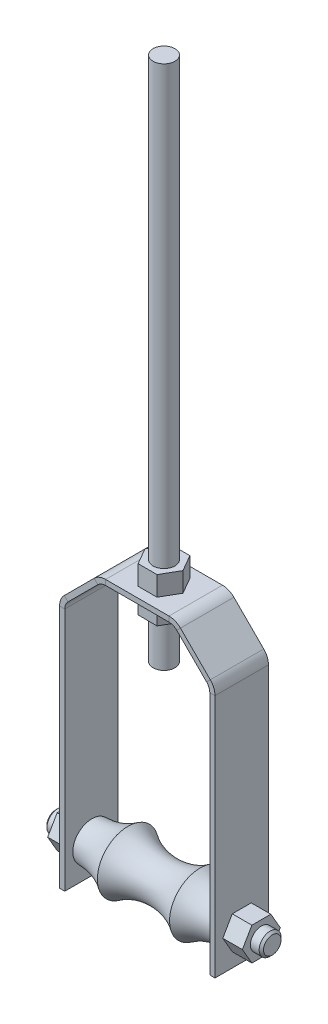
ISO-10303-21;
HEADER;
FILE_DESCRIPTION(('STEP AP214'),'2;1');
FILE_NAME('part.step','',(''),(''),'','','');
FILE_SCHEMA(('AUTOMOTIVE_DESIGN { 1 0 10303 214 1 1 1 1 }'));
ENDSEC;
DATA;
#1=APPLICATION_CONTEXT('core data for automotive mechanical design processes');
#2=APPLICATION_PROTOCOL_DEFINITION('international standard','automotive_design',2000,#1);
#3=PRODUCT_CONTEXT('',#1,'mechanical');
#4=PRODUCT('Part','Part','',(#3));
#5=PRODUCT_RELATED_PRODUCT_CATEGORY('part','',(#4));
#6=PRODUCT_DEFINITION_FORMATION('','',#4);
#7=PRODUCT_DEFINITION_CONTEXT('part definition',#1,'design');
#8=PRODUCT_DEFINITION('design','',#6,#7);
#9=PRODUCT_DEFINITION_SHAPE('','',#8);
#10=(LENGTH_UNIT() NAMED_UNIT(*) SI_UNIT(.MILLI.,.METRE.));
#11=(NAMED_UNIT(*) PLANE_ANGLE_UNIT() SI_UNIT($,.RADIAN.));
#12=(NAMED_UNIT(*) SI_UNIT($,.STERADIAN.) SOLID_ANGLE_UNIT());
#13=UNCERTAINTY_MEASURE_WITH_UNIT(LENGTH_MEASURE(1.E-05),#10,'distance_accuracy_value','');
#14=(GEOMETRIC_REPRESENTATION_CONTEXT(3) GLOBAL_UNCERTAINTY_ASSIGNED_CONTEXT((#13)) GLOBAL_UNIT_ASSIGNED_CONTEXT((#10,
#11,#12)) REPRESENTATION_CONTEXT('',''));
#15=CARTESIAN_POINT('',(0.,0.,0.));
#16=DIRECTION('',(0.,0.,1.));
#17=DIRECTION('',(1.,0.,0.));
#18=AXIS2_PLACEMENT_3D('',#15,#16,#17);
#19=CARTESIAN_POINT('',(0.,368.17046,0.));
#20=DIRECTION('',(0.,1.,0.));
#21=DIRECTION('',(0.,0.,1.));
#22=AXIS2_PLACEMENT_3D('',#19,#20,#21);
#23=PLANE('',#22);
#24=CARTESIAN_POINT('',(0.,368.17046,0.));
#25=DIRECTION('',(0.,-1.,0.));
#26=DIRECTION('',(0.,0.,-1.));
#27=AXIS2_PLACEMENT_3D('',#24,#25,#26);
#28=CIRCLE('',#27,6.35);
#29=CARTESIAN_POINT('',(0.,368.17046,-6.35));
#30=VERTEX_POINT('',#29);
#31=EDGE_CURVE('E11',#30,#30,#28,.T.);
#32=ORIENTED_EDGE('',*,*,#31,.F.);
#33=EDGE_LOOP('',(#32));
#34=FACE_BOUND('',#33,.T.);
#35=ADVANCED_FACE('F47',(#34),#23,.T.);
#36=CARTESIAN_POINT('',(0.,0.,0.));
#37=DIRECTION('',(0.,-1.,0.));
#38=DIRECTION('',(0.,0.,-1.));
#39=AXIS2_PLACEMENT_3D('',#36,#37,#38);
#40=CYLINDRICAL_SURFACE('',#39,6.35);
#41=ORIENTED_EDGE('',*,*,#31,.T.);
#42=EDGE_LOOP('',(#41));
#43=FACE_BOUND('',#42,.T.);
#44=CARTESIAN_POINT('',(0.,63.37046,0.));
#45=DIRECTION('',(0.,-1.,0.));
#46=DIRECTION('',(0.,0.,-1.));
#47=AXIS2_PLACEMENT_3D('',#44,#45,#46);
#48=CIRCLE('',#47,6.35);
#49=CARTESIAN_POINT('',(0.,63.37046,-6.35));
#50=VERTEX_POINT('',#49);
#51=EDGE_CURVE('E53',#50,#50,#48,.T.);
#52=ORIENTED_EDGE('',*,*,#51,.F.);
#53=EDGE_LOOP('',(#52));
#54=FACE_BOUND('',#53,.T.);
#55=ADVANCED_FACE('F61',(#43,#54),#40,.T.);
#56=CARTESIAN_POINT('',(0.,63.37046,0.));
#57=DIRECTION('',(0.,-1.,0.));
#58=DIRECTION('',(0.,0.,-1.));
#59=AXIS2_PLACEMENT_3D('',#56,#57,#58);
#60=PLANE('',#59);
#61=ORIENTED_EDGE('',*,*,#51,.T.);
#62=EDGE_LOOP('',(#61));
#63=FACE_BOUND('',#62,.T.);
#64=ADVANCED_FACE('F59',(#63),#60,.T.);
#65=CLOSED_SHELL('',(#35,#55,#64));
#66=MANIFOLD_SOLID_BREP('B2',#65);
#67=CARTESIAN_POINT('',(-56.48579,-38.1,5.49926131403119));
#68=DIRECTION('',(-1.,0.,0.));
#69=DIRECTION('',(0.,0.5,-0.866025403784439));
#70=AXIS2_PLACEMENT_3D('',#67,#68,#69);
#71=PLANE('',#70);
#72=DIRECTION('',(0.,0.,1.));
#73=VECTOR('',#72,1.);
#74=CARTESIAN_POINT('',(-56.48579,-38.1,-5.49926131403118));
#75=LINE('',#74,#73);
#76=CARTESIAN_POINT('',(-56.48579,-38.1,-5.49926131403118));
#77=VERTEX_POINT('',#76);
#78=CARTESIAN_POINT('',(-56.48579,-38.1,5.49926131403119));
#79=VERTEX_POINT('',#78);
#80=EDGE_CURVE('E208',#77,#79,#75,.T.);
#81=ORIENTED_EDGE('',*,*,#80,.F.);
#82=DIRECTION('',(0.,0.866025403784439,0.5));
#83=VECTOR('',#82,1.);
#84=CARTESIAN_POINT('',(-56.48579,-47.625,-10.9985226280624));
#85=LINE('',#84,#83);
#86=CARTESIAN_POINT('',(-56.48579,-47.625,-10.9985226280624));
#87=VERTEX_POINT('',#86);
#88=EDGE_CURVE('E188',#87,#77,#85,.T.);
#89=ORIENTED_EDGE('',*,*,#88,.F.);
#90=DIRECTION('',(0.,0.866025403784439,-0.5));
#91=VECTOR('',#90,1.);
#92=CARTESIAN_POINT('',(-56.48579,-57.15,-5.49926131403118));
#93=LINE('',#92,#91);
#94=CARTESIAN_POINT('',(-56.48579,-57.15,-5.49926131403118));
#95=VERTEX_POINT('',#94);
#96=EDGE_CURVE('E169',#95,#87,#93,.T.);
#97=ORIENTED_EDGE('',*,*,#96,.F.);
#98=DIRECTION('',(0.,0.,-1.));
#99=VECTOR('',#98,1.);
#100=CARTESIAN_POINT('',(-56.48579,-57.15,5.49926131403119));
#101=LINE('',#100,#99);
#102=CARTESIAN_POINT('',(-56.48579,-57.15,5.49926131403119));
#103=VERTEX_POINT('',#102);
#104=EDGE_CURVE('E179',#103,#95,#101,.T.);
#105=ORIENTED_EDGE('',*,*,#104,.F.);
#106=DIRECTION('',(0.,-0.866025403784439,-0.5));
#107=VECTOR('',#106,1.);
#108=CARTESIAN_POINT('',(-56.48579,-47.625,10.9985226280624));
#109=LINE('',#108,#107);
#110=CARTESIAN_POINT('',(-56.48579,-47.625,10.9985226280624));
#111=VERTEX_POINT('',#110);
#112=EDGE_CURVE('E184',#111,#103,#109,.T.);
#113=ORIENTED_EDGE('',*,*,#112,.F.);
#114=DIRECTION('',(0.,-0.866025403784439,0.5));
#115=VECTOR('',#114,1.);
#116=CARTESIAN_POINT('',(-56.48579,-38.1,5.49926131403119));
#117=LINE('',#116,#115);
#118=EDGE_CURVE('E213',#79,#111,#117,.T.);
#119=ORIENTED_EDGE('',*,*,#118,.F.);
#120=EDGE_LOOP('',(#81,#89,#97,#105,#113,#119));
#121=FACE_BOUND('',#120,.T.);
#122=CARTESIAN_POINT('',(-56.48579,-47.625,0.));
#123=DIRECTION('',(1.,0.,0.));
#124=DIRECTION('',(0.,0.5,-0.866025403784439));
#125=AXIS2_PLACEMENT_3D('',#122,#123,#124);
#126=CIRCLE('',#125,5.35813);
#127=CARTESIAN_POINT('',(-56.48579,-44.945935,-4.64027669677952));
#128=VERTEX_POINT('',#127);
#129=EDGE_CURVE('E197',#128,#128,#126,.T.);
#130=ORIENTED_EDGE('',*,*,#129,.T.);
#131=EDGE_LOOP('',(#130));
#132=FACE_BOUND('',#131,.T.);
#133=ADVANCED_FACE('F108',(#121,#132),#71,.T.);
#134=CARTESIAN_POINT('',(-45.10659,-38.1,5.49926131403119));
#135=DIRECTION('',(-1.,0.,0.));
#136=DIRECTION('',(0.,0.5,-0.866025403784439));
#137=AXIS2_PLACEMENT_3D('',#134,#135,#136);
#138=PLANE('',#137);
#139=DIRECTION('',(0.,0.,1.));
#140=VECTOR('',#139,1.);
#141=CARTESIAN_POINT('',(-45.10659,-38.1,-5.49926131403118));
#142=LINE('',#141,#140);
#143=CARTESIAN_POINT('',(-45.10659,-38.1,-5.49926131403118));
#144=VERTEX_POINT('',#143);
#145=CARTESIAN_POINT('',(-45.10659,-38.1,5.49926131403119));
#146=VERTEX_POINT('',#145);
#147=EDGE_CURVE('E193',#144,#146,#142,.T.);
#148=ORIENTED_EDGE('',*,*,#147,.T.);
#149=DIRECTION('',(0.,-0.866025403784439,0.5));
#150=VECTOR('',#149,1.);
#151=CARTESIAN_POINT('',(-45.10659,-38.1,5.49926131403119));
#152=LINE('',#151,#150);
#153=CARTESIAN_POINT('',(-45.10659,-47.625,10.9985226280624));
#154=VERTEX_POINT('',#153);
#155=EDGE_CURVE('E196',#146,#154,#152,.T.);
#156=ORIENTED_EDGE('',*,*,#155,.T.);
#157=DIRECTION('',(0.,-0.866025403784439,-0.5));
#158=VECTOR('',#157,1.);
#159=CARTESIAN_POINT('',(-45.10659,-47.625,10.9985226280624));
#160=LINE('',#159,#158);
#161=CARTESIAN_POINT('',(-45.10659,-57.15,5.49926131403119));
#162=VERTEX_POINT('',#161);
#163=EDGE_CURVE('E200',#154,#162,#160,.T.);
#164=ORIENTED_EDGE('',*,*,#163,.T.);
#165=DIRECTION('',(0.,0.,-1.));
#166=VECTOR('',#165,1.);
#167=CARTESIAN_POINT('',(-45.10659,-57.15,5.49926131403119));
#168=LINE('',#167,#166);
#169=CARTESIAN_POINT('',(-45.10659,-57.15,-5.49926131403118));
#170=VERTEX_POINT('',#169);
#171=EDGE_CURVE('E203',#162,#170,#168,.T.);
#172=ORIENTED_EDGE('',*,*,#171,.T.);
#173=DIRECTION('',(0.,0.866025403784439,-0.5));
#174=VECTOR('',#173,1.);
#175=CARTESIAN_POINT('',(-45.10659,-57.15,-5.49926131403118));
#176=LINE('',#175,#174);
#177=CARTESIAN_POINT('',(-45.10659,-47.625,-10.9985226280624));
#178=VERTEX_POINT('',#177);
#179=EDGE_CURVE('E172',#170,#178,#176,.T.);
#180=ORIENTED_EDGE('',*,*,#179,.T.);
#181=DIRECTION('',(0.,0.866025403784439,0.5));
#182=VECTOR('',#181,1.);
#183=CARTESIAN_POINT('',(-45.10659,-47.625,-10.9985226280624));
#184=LINE('',#183,#182);
#185=EDGE_CURVE('E206',#178,#144,#184,.T.);
#186=ORIENTED_EDGE('',*,*,#185,.T.);
#187=EDGE_LOOP('',(#148,#156,#164,#172,#180,#186));
#188=FACE_BOUND('',#187,.T.);
#189=CARTESIAN_POINT('',(-45.10659,-47.625,0.));
#190=DIRECTION('',(1.,0.,0.));
#191=DIRECTION('',(0.,0.5,-0.866025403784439));
#192=AXIS2_PLACEMENT_3D('',#189,#190,#191);
#193=CIRCLE('',#192,5.35813);
#194=CARTESIAN_POINT('',(-45.10659,-44.945935,-4.64027669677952));
#195=VERTEX_POINT('',#194);
#196=EDGE_CURVE('E222',#195,#195,#193,.T.);
#197=ORIENTED_EDGE('',*,*,#196,.F.);
#198=EDGE_LOOP('',(#197));
#199=FACE_BOUND('',#198,.T.);
#200=ADVANCED_FACE('F217',(#188,#199),#138,.F.);
#201=CARTESIAN_POINT('',(-56.48579,-38.1,-5.49926131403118));
#202=DIRECTION('',(0.,-1.,0.));
#203=DIRECTION('',(0.,0.,-1.));
#204=AXIS2_PLACEMENT_3D('',#201,#202,#203);
#205=PLANE('',#204);
#206=ORIENTED_EDGE('',*,*,#147,.F.);
#207=DIRECTION('',(1.,0.,0.));
#208=VECTOR('',#207,1.);
#209=CARTESIAN_POINT('',(-56.48579,-38.1,-5.49926131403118));
#210=LINE('',#209,#208);
#211=EDGE_CURVE('E125',#77,#144,#210,.T.);
#212=ORIENTED_EDGE('',*,*,#211,.F.);
#213=ORIENTED_EDGE('',*,*,#80,.T.);
#214=DIRECTION('',(1.,0.,0.));
#215=VECTOR('',#214,1.);
#216=CARTESIAN_POINT('',(-56.48579,-38.1,5.49926131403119));
#217=LINE('',#216,#215);
#218=EDGE_CURVE('E45',#79,#146,#217,.T.);
#219=ORIENTED_EDGE('',*,*,#218,.T.);
#220=EDGE_LOOP('',(#206,#212,#213,#219));
#221=FACE_BOUND('',#220,.T.);
#222=ADVANCED_FACE('F110',(#221),#205,.F.);
#223=CARTESIAN_POINT('',(-56.48579,-38.1,5.49926131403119));
#224=DIRECTION('',(0.,-0.5,-0.866025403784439));
#225=DIRECTION('',(0.,0.866025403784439,-0.5));
#226=AXIS2_PLACEMENT_3D('',#223,#224,#225);
#227=PLANE('',#226);
#228=ORIENTED_EDGE('',*,*,#155,.F.);
#229=ORIENTED_EDGE('',*,*,#218,.F.);
#230=ORIENTED_EDGE('',*,*,#118,.T.);
#231=DIRECTION('',(1.,0.,0.));
#232=VECTOR('',#231,1.);
#233=CARTESIAN_POINT('',(-56.48579,-47.625,10.9985226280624));
#234=LINE('',#233,#232);
#235=EDGE_CURVE('E117',#111,#154,#234,.T.);
#236=ORIENTED_EDGE('',*,*,#235,.T.);
#237=EDGE_LOOP('',(#228,#229,#230,#236));
#238=FACE_BOUND('',#237,.T.);
#239=ADVANCED_FACE('F212',(#238),#227,.F.);
#240=CARTESIAN_POINT('',(-56.48579,-47.625,10.9985226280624));
#241=DIRECTION('',(0.,0.5,-0.866025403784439));
#242=DIRECTION('',(0.,0.866025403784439,0.5));
#243=AXIS2_PLACEMENT_3D('',#240,#241,#242);
#244=PLANE('',#243);
#245=ORIENTED_EDGE('',*,*,#163,.F.);
#246=ORIENTED_EDGE('',*,*,#235,.F.);
#247=ORIENTED_EDGE('',*,*,#112,.T.);
#248=DIRECTION('',(1.,0.,0.));
#249=VECTOR('',#248,1.);
#250=CARTESIAN_POINT('',(-56.48579,-57.15,5.49926131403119));
#251=LINE('',#250,#249);
#252=EDGE_CURVE('E176',#103,#162,#251,.T.);
#253=ORIENTED_EDGE('',*,*,#252,.T.);
#254=EDGE_LOOP('',(#245,#246,#247,#253));
#255=FACE_BOUND('',#254,.T.);
#256=ADVANCED_FACE('F215',(#255),#244,.F.);
#257=CARTESIAN_POINT('',(-56.48579,-57.15,5.49926131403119));
#258=DIRECTION('',(0.,1.,0.));
#259=DIRECTION('',(0.,0.,1.));
#260=AXIS2_PLACEMENT_3D('',#257,#258,#259);
#261=PLANE('',#260);
#262=ORIENTED_EDGE('',*,*,#171,.F.);
#263=ORIENTED_EDGE('',*,*,#252,.F.);
#264=ORIENTED_EDGE('',*,*,#104,.T.);
#265=DIRECTION('',(1.,0.,0.));
#266=VECTOR('',#265,1.);
#267=CARTESIAN_POINT('',(-56.48579,-57.15,-5.49926131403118));
#268=LINE('',#267,#266);
#269=EDGE_CURVE('E165',#95,#170,#268,.T.);
#270=ORIENTED_EDGE('',*,*,#269,.T.);
#271=EDGE_LOOP('',(#262,#263,#264,#270));
#272=FACE_BOUND('',#271,.T.);
#273=ADVANCED_FACE('F180',(#272),#261,.F.);
#274=CARTESIAN_POINT('',(-56.48579,-57.15,-5.49926131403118));
#275=DIRECTION('',(0.,0.5,0.866025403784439));
#276=DIRECTION('',(0.,-0.866025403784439,0.5));
#277=AXIS2_PLACEMENT_3D('',#274,#275,#276);
#278=PLANE('',#277);
#279=ORIENTED_EDGE('',*,*,#179,.F.);
#280=ORIENTED_EDGE('',*,*,#269,.F.);
#281=ORIENTED_EDGE('',*,*,#96,.T.);
#282=DIRECTION('',(1.,0.,0.));
#283=VECTOR('',#282,1.);
#284=CARTESIAN_POINT('',(-56.48579,-47.625,-10.9985226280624));
#285=LINE('',#284,#283);
#286=EDGE_CURVE('E147',#87,#178,#285,.T.);
#287=ORIENTED_EDGE('',*,*,#286,.T.);
#288=EDGE_LOOP('',(#279,#280,#281,#287));
#289=FACE_BOUND('',#288,.T.);
#290=ADVANCED_FACE('F167',(#289),#278,.F.);
#291=CARTESIAN_POINT('',(-56.48579,-47.625,-10.9985226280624));
#292=DIRECTION('',(0.,-0.5,0.866025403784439));
#293=DIRECTION('',(0.,-0.866025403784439,-0.5));
#294=AXIS2_PLACEMENT_3D('',#291,#292,#293);
#295=PLANE('',#294);
#296=ORIENTED_EDGE('',*,*,#185,.F.);
#297=ORIENTED_EDGE('',*,*,#286,.F.);
#298=ORIENTED_EDGE('',*,*,#88,.T.);
#299=ORIENTED_EDGE('',*,*,#211,.T.);
#300=EDGE_LOOP('',(#296,#297,#298,#299));
#301=FACE_BOUND('',#300,.T.);
#302=ADVANCED_FACE('F231',(#301),#295,.F.);
#303=CARTESIAN_POINT('',(-56.48579,-47.625,0.));
#304=DIRECTION('',(1.,0.,0.));
#305=DIRECTION('',(0.,-0.5,0.866025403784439));
#306=AXIS2_PLACEMENT_3D('',#303,#304,#305);
#307=CYLINDRICAL_SURFACE('',#306,5.35813);
#308=ORIENTED_EDGE('',*,*,#129,.F.);
#309=EDGE_LOOP('',(#308));
#310=FACE_BOUND('',#309,.T.);
#311=ORIENTED_EDGE('',*,*,#196,.T.);
#312=EDGE_LOOP('',(#311));
#313=FACE_BOUND('',#312,.T.);
#314=ADVANCED_FACE('F228',(#310,#313),#307,.F.);
#315=CLOSED_SHELL('',(#133,#200,#222,#239,#256,#273,#290,#302,#314));
#316=MANIFOLD_SOLID_BREP('B6',#315);
#317=CARTESIAN_POINT('',(62.83579,-41.275,0.));
#318=DIRECTION('',(1.,0.,0.));
#319=DIRECTION('',(0.,1.,0.));
#320=AXIS2_PLACEMENT_3D('',#317,#318,#319);
#321=PLANE('',#320);
#322=CARTESIAN_POINT('',(62.83579,-47.625,0.));
#323=DIRECTION('',(1.,0.,0.));
#324=DIRECTION('',(0.,1.,0.));
#325=AXIS2_PLACEMENT_3D('',#322,#323,#324);
#326=CIRCLE('',#325,5.08000000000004);
#327=CARTESIAN_POINT('',(62.83579,-42.5449999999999,0.));
#328=VERTEX_POINT('',#327);
#329=EDGE_CURVE('E356',#328,#328,#326,.T.);
#330=ORIENTED_EDGE('',*,*,#329,.T.);
#331=EDGE_LOOP('',(#330));
#332=FACE_BOUND('',#331,.T.);
#333=ADVANCED_FACE('F341',(#332),#321,.T.);
#334=CARTESIAN_POINT('',(116.79786007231,-47.625,0.));
#335=DIRECTION('',(1.,0.,0.));
#336=DIRECTION('',(0.,1.,0.));
#337=AXIS2_PLACEMENT_3D('',#334,#335,#336);
#338=CYLINDRICAL_SURFACE('',#337,6.34999999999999);
#339=CARTESIAN_POINT('',(61.56579,-47.625,0.));
#340=DIRECTION('',(1.,0.,0.));
#341=DIRECTION('',(0.,0.,-1.));
#342=AXIS2_PLACEMENT_3D('',#339,#340,#341);
#343=CIRCLE('',#342,6.34999999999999);
#344=CARTESIAN_POINT('',(61.56579,-47.625,-6.34999999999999));
#345=VERTEX_POINT('',#344);
#346=EDGE_CURVE('E348',#345,#345,#343,.F.);
#347=ORIENTED_EDGE('',*,*,#346,.T.);
#348=EDGE_LOOP('',(#347));
#349=FACE_BOUND('',#348,.T.);
#350=CARTESIAN_POINT('',(-61.56579,-47.625,0.));
#351=DIRECTION('',(-1.,0.,0.));
#352=DIRECTION('',(0.,0.,1.));
#353=AXIS2_PLACEMENT_3D('',#350,#351,#352);
#354=CIRCLE('',#353,6.34999999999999);
#355=CARTESIAN_POINT('',(-61.56579,-47.625,6.34999999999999));
#356=VERTEX_POINT('',#355);
#357=EDGE_CURVE('E352',#356,#356,#354,.F.);
#358=ORIENTED_EDGE('',*,*,#357,.T.);
#359=EDGE_LOOP('',(#358));
#360=FACE_BOUND('',#359,.T.);
#361=ADVANCED_FACE('F372',(#349,#360),#338,.T.);
#362=CARTESIAN_POINT('',(-62.83579,-41.275,0.));
#363=DIRECTION('',(-1.,0.,0.));
#364=DIRECTION('',(0.,-1.,0.));
#365=AXIS2_PLACEMENT_3D('',#362,#363,#364);
#366=PLANE('',#365);
#367=CARTESIAN_POINT('',(-62.83579,-47.625,0.));
#368=DIRECTION('',(-1.,0.,0.));
#369=DIRECTION('',(0.,-1.,0.));
#370=AXIS2_PLACEMENT_3D('',#367,#368,#369);
#371=CIRCLE('',#370,5.08000000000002);
#372=CARTESIAN_POINT('',(-62.83579,-52.705,0.));
#373=VERTEX_POINT('',#372);
#374=EDGE_CURVE('E107',#373,#373,#371,.T.);
#375=ORIENTED_EDGE('',*,*,#374,.T.);
#376=EDGE_LOOP('',(#375));
#377=FACE_BOUND('',#376,.T.);
#378=ADVANCED_FACE('F365',(#377),#366,.T.);
#379=CARTESIAN_POINT('',(62.83579,-47.625,0.));
#380=DIRECTION('',(-1.,0.,0.));
#381=DIRECTION('',(0.,0.,1.));
#382=AXIS2_PLACEMENT_3D('',#379,#380,#381);
#383=CONICAL_SURFACE('',#382,5.08000000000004,0.785398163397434);
#384=ORIENTED_EDGE('',*,*,#346,.F.);
#385=EDGE_LOOP('',(#384));
#386=FACE_BOUND('',#385,.T.);
#387=ORIENTED_EDGE('',*,*,#329,.F.);
#388=EDGE_LOOP('',(#387));
#389=FACE_BOUND('',#388,.T.);
#390=ADVANCED_FACE('F363',(#386,#389),#383,.T.);
#391=CARTESIAN_POINT('',(-61.56579,-47.625,0.));
#392=DIRECTION('',(1.,0.,0.));
#393=DIRECTION('',(0.,0.,-1.));
#394=AXIS2_PLACEMENT_3D('',#391,#392,#393);
#395=CONICAL_SURFACE('',#394,6.34999999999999,0.785398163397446);
#396=ORIENTED_EDGE('',*,*,#374,.F.);
#397=EDGE_LOOP('',(#396));
#398=FACE_BOUND('',#397,.T.);
#399=ORIENTED_EDGE('',*,*,#357,.F.);
#400=EDGE_LOOP('',(#399));
#401=FACE_BOUND('',#400,.T.);
#402=ADVANCED_FACE('F343',(#398,#401),#395,.T.);
#403=CLOSED_SHELL('',(#333,#361,#378,#390,#402));
#404=MANIFOLD_SOLID_BREP('B39',#403);
#405=CARTESIAN_POINT('',(41.8854192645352,-47.625,0.));
#406=DIRECTION('',(1.,0.,0.));
#407=DIRECTION('',(0.,1.,0.));
#408=AXIS2_PLACEMENT_3D('',#405,#406,#407);
#409=TOROIDAL_SURFACE('',#408,47.625,36.5125);
#410=CARTESIAN_POINT('',(20.9427096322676,-47.625,0.));
#411=DIRECTION('',(1.,0.,0.));
#412=DIRECTION('',(0.,1.,0.));
#413=AXIS2_PLACEMENT_3D('',#410,#411,#412);
#414=CIRCLE('',#413,17.7157109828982);
#415=CARTESIAN_POINT('',(20.9427096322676,-29.9092890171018,0.));
#416=VERTEX_POINT('',#415);
#417=EDGE_CURVE('E443',#416,#416,#414,.T.);
#418=ORIENTED_EDGE('',*,*,#417,.T.);
#419=EDGE_LOOP('',(#418));
#420=FACE_BOUND('',#419,.T.);
#421=CARTESIAN_POINT('',(41.81475,-47.625,0.));
#422=DIRECTION('',(1.,0.,0.));
#423=DIRECTION('',(0.,1.,0.));
#424=AXIS2_PLACEMENT_3D('',#421,#422,#423);
#425=CIRCLE('',#424,11.1125683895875);
#426=CARTESIAN_POINT('',(41.81475,-36.5124316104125,0.));
#427=VERTEX_POINT('',#426);
#428=EDGE_CURVE('E340',#427,#427,#425,.T.);
#429=ORIENTED_EDGE('',*,*,#428,.F.);
#430=EDGE_LOOP('',(#429));
#431=FACE_BOUND('',#430,.T.);
#432=ADVANCED_FACE('F421',(#420,#431),#409,.F.);
#433=CARTESIAN_POINT('',(41.81475,-36.5124316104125,0.));
#434=DIRECTION('',(1.,0.,0.));
#435=DIRECTION('',(0.,1.,0.));
#436=AXIS2_PLACEMENT_3D('',#433,#434,#435);
#437=PLANE('',#436);
#438=ORIENTED_EDGE('',*,*,#428,.T.);
#439=EDGE_LOOP('',(#438));
#440=FACE_BOUND('',#439,.T.);
#441=CARTESIAN_POINT('',(41.81475,-47.625,0.));
#442=DIRECTION('',(1.,0.,0.));
#443=DIRECTION('',(0.,1.,0.));
#444=AXIS2_PLACEMENT_3D('',#441,#442,#443);
#445=CIRCLE('',#444,6.60399999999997);
#446=CARTESIAN_POINT('',(41.81475,-41.021,0.));
#447=VERTEX_POINT('',#446);
#448=EDGE_CURVE('E427',#447,#447,#445,.T.);
#449=ORIENTED_EDGE('',*,*,#448,.F.);
#450=EDGE_LOOP('',(#449));
#451=FACE_BOUND('',#450,.T.);
#452=ADVANCED_FACE('F461',(#440,#451),#437,.T.);
#453=CARTESIAN_POINT('',(116.79786007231,-47.625,0.));
#454=DIRECTION('',(1.,0.,0.));
#455=DIRECTION('',(0.,1.,0.));
#456=AXIS2_PLACEMENT_3D('',#453,#454,#455);
#457=CYLINDRICAL_SURFACE('',#456,6.60399999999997);
#458=ORIENTED_EDGE('',*,*,#448,.T.);
#459=EDGE_LOOP('',(#458));
#460=FACE_BOUND('',#459,.T.);
#461=CARTESIAN_POINT('',(-41.81475,-47.625,0.));
#462=DIRECTION('',(1.,0.,0.));
#463=DIRECTION('',(0.,1.,0.));
#464=AXIS2_PLACEMENT_3D('',#461,#462,#463);
#465=CIRCLE('',#464,6.60399999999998);
#466=CARTESIAN_POINT('',(-41.81475,-41.021,0.));
#467=VERTEX_POINT('',#466);
#468=EDGE_CURVE('E431',#467,#467,#465,.T.);
#469=ORIENTED_EDGE('',*,*,#468,.F.);
#470=EDGE_LOOP('',(#469));
#471=FACE_BOUND('',#470,.T.);
#472=ADVANCED_FACE('F465',(#460,#471),#457,.F.);
#473=CARTESIAN_POINT('',(-41.81475,-36.5124316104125,0.));
#474=DIRECTION('',(-1.,0.,0.));
#475=DIRECTION('',(0.,-1.,0.));
#476=AXIS2_PLACEMENT_3D('',#473,#474,#475);
#477=PLANE('',#476);
#478=ORIENTED_EDGE('',*,*,#468,.T.);
#479=EDGE_LOOP('',(#478));
#480=FACE_BOUND('',#479,.T.);
#481=CARTESIAN_POINT('',(-41.81475,-47.625,0.));
#482=DIRECTION('',(1.,0.,0.));
#483=DIRECTION('',(0.,1.,0.));
#484=AXIS2_PLACEMENT_3D('',#481,#482,#483);
#485=CIRCLE('',#484,11.1125683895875);
#486=CARTESIAN_POINT('',(-41.81475,-36.5124316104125,0.));
#487=VERTEX_POINT('',#486);
#488=EDGE_CURVE('E435',#487,#487,#485,.T.);
#489=ORIENTED_EDGE('',*,*,#488,.F.);
#490=EDGE_LOOP('',(#489));
#491=FACE_BOUND('',#490,.T.);
#492=ADVANCED_FACE('F457',(#480,#491),#477,.T.);
#493=CARTESIAN_POINT('',(-41.8854192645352,-47.625,0.));
#494=DIRECTION('',(1.,0.,0.));
#495=DIRECTION('',(0.,1.,0.));
#496=AXIS2_PLACEMENT_3D('',#493,#494,#495);
#497=TOROIDAL_SURFACE('',#496,47.625,36.5125);
#498=ORIENTED_EDGE('',*,*,#488,.T.);
#499=EDGE_LOOP('',(#498));
#500=FACE_BOUND('',#499,.T.);
#501=CARTESIAN_POINT('',(-20.9427096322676,-47.625,0.));
#502=DIRECTION('',(1.,0.,0.));
#503=DIRECTION('',(0.,1.,0.));
#504=AXIS2_PLACEMENT_3D('',#501,#502,#503);
#505=CIRCLE('',#504,17.7157109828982);
#506=CARTESIAN_POINT('',(-20.9427096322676,-29.9092890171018,0.));
#507=VERTEX_POINT('',#506);
#508=EDGE_CURVE('E440',#507,#507,#505,.T.);
#509=ORIENTED_EDGE('',*,*,#508,.F.);
#510=EDGE_LOOP('',(#509));
#511=FACE_BOUND('',#510,.T.);
#512=ADVANCED_FACE('F451',(#500,#511),#497,.F.);
#513=CARTESIAN_POINT('',(0.,-47.625,0.));
#514=DIRECTION('',(1.,0.,0.));
#515=DIRECTION('',(0.,1.,0.));
#516=AXIS2_PLACEMENT_3D('',#513,#514,#515);
#517=TOROIDAL_SURFACE('',#516,47.625,36.5125);
#518=ORIENTED_EDGE('',*,*,#508,.T.);
#519=EDGE_LOOP('',(#518));
#520=FACE_BOUND('',#519,.T.);
#521=ORIENTED_EDGE('',*,*,#417,.F.);
#522=EDGE_LOOP('',(#521));
#523=FACE_BOUND('',#522,.T.);
#524=ADVANCED_FACE('F449',(#520,#523),#517,.F.);
#525=CLOSED_SHELL('',(#432,#452,#472,#492,#512,#524));
#526=MANIFOLD_SOLID_BREP('B102',#525);
#527=CARTESIAN_POINT('',(56.48579,-38.1,5.49926131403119));
#528=DIRECTION('',(1.,0.,0.));
#529=DIRECTION('',(0.,0.5,-0.866025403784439));
#530=AXIS2_PLACEMENT_3D('',#527,#528,#529);
#531=PLANE('',#530);
#532=DIRECTION('',(0.,0.,1.));
#533=VECTOR('',#532,1.);
#534=CARTESIAN_POINT('',(56.48579,-38.1,-5.49926131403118));
#535=LINE('',#534,#533);
#536=CARTESIAN_POINT('',(56.48579,-38.1,-5.49926131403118));
#537=VERTEX_POINT('',#536);
#538=CARTESIAN_POINT('',(56.48579,-38.1,5.49926131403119));
#539=VERTEX_POINT('',#538);
#540=EDGE_CURVE('E621',#537,#539,#535,.T.);
#541=ORIENTED_EDGE('',*,*,#540,.T.);
#542=DIRECTION('',(0.,-0.866025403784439,0.5));
#543=VECTOR('',#542,1.);
#544=CARTESIAN_POINT('',(56.48579,-38.1,5.49926131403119));
#545=LINE('',#544,#543);
#546=CARTESIAN_POINT('',(56.48579,-47.625,10.9985226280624));
#547=VERTEX_POINT('',#546);
#548=EDGE_CURVE('E579',#539,#547,#545,.T.);
#549=ORIENTED_EDGE('',*,*,#548,.T.);
#550=DIRECTION('',(0.,-0.866025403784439,-0.5));
#551=VECTOR('',#550,1.);
#552=CARTESIAN_POINT('',(56.48579,-47.625,10.9985226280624));
#553=LINE('',#552,#551);
#554=CARTESIAN_POINT('',(56.48579,-57.15,5.49926131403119));
#555=VERTEX_POINT('',#554);
#556=EDGE_CURVE('E592',#547,#555,#553,.T.);
#557=ORIENTED_EDGE('',*,*,#556,.T.);
#558=DIRECTION('',(0.,0.,-1.));
#559=VECTOR('',#558,1.);
#560=CARTESIAN_POINT('',(56.48579,-57.15,5.49926131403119));
#561=LINE('',#560,#559);
#562=CARTESIAN_POINT('',(56.48579,-57.15,-5.49926131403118));
#563=VERTEX_POINT('',#562);
#564=EDGE_CURVE('E586',#555,#563,#561,.T.);
#565=ORIENTED_EDGE('',*,*,#564,.T.);
#566=DIRECTION('',(0.,0.866025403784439,-0.5));
#567=VECTOR('',#566,1.);
#568=CARTESIAN_POINT('',(56.48579,-57.15,-5.49926131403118));
#569=LINE('',#568,#567);
#570=CARTESIAN_POINT('',(56.48579,-47.625,-10.9985226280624));
#571=VERTEX_POINT('',#570);
#572=EDGE_CURVE('E590',#563,#571,#569,.T.);
#573=ORIENTED_EDGE('',*,*,#572,.T.);
#574=DIRECTION('',(0.,0.866025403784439,0.5));
#575=VECTOR('',#574,1.);
#576=CARTESIAN_POINT('',(56.48579,-47.625,-10.9985226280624));
#577=LINE('',#576,#575);
#578=EDGE_CURVE('E542',#571,#537,#577,.T.);
#579=ORIENTED_EDGE('',*,*,#578,.T.);
#580=EDGE_LOOP('',(#541,#549,#557,#565,#573,#579));
#581=FACE_BOUND('',#580,.T.);
#582=CARTESIAN_POINT('',(56.48579,-47.625,0.));
#583=DIRECTION('',(1.,0.,0.));
#584=DIRECTION('',(0.,0.5,-0.866025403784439));
#585=AXIS2_PLACEMENT_3D('',#582,#583,#584);
#586=CIRCLE('',#585,5.35813);
#587=CARTESIAN_POINT('',(56.48579,-44.945935,-4.64027669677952));
#588=VERTEX_POINT('',#587);
#589=EDGE_CURVE('E614',#588,#588,#586,.T.);
#590=ORIENTED_EDGE('',*,*,#589,.F.);
#591=EDGE_LOOP('',(#590));
#592=FACE_BOUND('',#591,.T.);
#593=ADVANCED_FACE('F525',(#581,#592),#531,.T.);
#594=CARTESIAN_POINT('',(45.10659,-38.1,5.49926131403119));
#595=DIRECTION('',(1.,0.,0.));
#596=DIRECTION('',(0.,0.5,-0.866025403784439));
#597=AXIS2_PLACEMENT_3D('',#594,#595,#596);
#598=PLANE('',#597);
#599=DIRECTION('',(0.,0.,1.));
#600=VECTOR('',#599,1.);
#601=CARTESIAN_POINT('',(45.10659,-38.1,-5.49926131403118));
#602=LINE('',#601,#600);
#603=CARTESIAN_POINT('',(45.10659,-38.1,-5.49926131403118));
#604=VERTEX_POINT('',#603);
#605=CARTESIAN_POINT('',(45.10659,-38.1,5.49926131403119));
#606=VERTEX_POINT('',#605);
#607=EDGE_CURVE('E610',#604,#606,#602,.T.);
#608=ORIENTED_EDGE('',*,*,#607,.F.);
#609=DIRECTION('',(0.,0.866025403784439,0.5));
#610=VECTOR('',#609,1.);
#611=CARTESIAN_POINT('',(45.10659,-47.625,-10.9985226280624));
#612=LINE('',#611,#610);
#613=CARTESIAN_POINT('',(45.10659,-47.625,-10.9985226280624));
#614=VERTEX_POINT('',#613);
#615=EDGE_CURVE('E571',#614,#604,#612,.T.);
#616=ORIENTED_EDGE('',*,*,#615,.F.);
#617=DIRECTION('',(0.,0.866025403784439,-0.5));
#618=VECTOR('',#617,1.);
#619=CARTESIAN_POINT('',(45.10659,-57.15,-5.49926131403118));
#620=LINE('',#619,#618);
#621=CARTESIAN_POINT('',(45.10659,-57.15,-5.49926131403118));
#622=VERTEX_POINT('',#621);
#623=EDGE_CURVE('E565',#622,#614,#620,.T.);
#624=ORIENTED_EDGE('',*,*,#623,.F.);
#625=DIRECTION('',(0.,0.,-1.));
#626=VECTOR('',#625,1.);
#627=CARTESIAN_POINT('',(45.10659,-57.15,5.49926131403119));
#628=LINE('',#627,#626);
#629=CARTESIAN_POINT('',(45.10659,-57.15,5.49926131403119));
#630=VERTEX_POINT('',#629);
#631=EDGE_CURVE('E600',#630,#622,#628,.T.);
#632=ORIENTED_EDGE('',*,*,#631,.F.);
#633=DIRECTION('',(0.,-0.866025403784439,-0.5));
#634=VECTOR('',#633,1.);
#635=CARTESIAN_POINT('',(45.10659,-47.625,10.9985226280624));
#636=LINE('',#635,#634);
#637=CARTESIAN_POINT('',(45.10659,-47.625,10.9985226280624));
#638=VERTEX_POINT('',#637);
#639=EDGE_CURVE('E616',#638,#630,#636,.T.);
#640=ORIENTED_EDGE('',*,*,#639,.F.);
#641=DIRECTION('',(0.,-0.866025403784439,0.5));
#642=VECTOR('',#641,1.);
#643=CARTESIAN_POINT('',(45.10659,-38.1,5.49926131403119));
#644=LINE('',#643,#642);
#645=EDGE_CURVE('E613',#606,#638,#644,.T.);
#646=ORIENTED_EDGE('',*,*,#645,.F.);
#647=EDGE_LOOP('',(#608,#616,#624,#632,#640,#646));
#648=FACE_BOUND('',#647,.T.);
#649=CARTESIAN_POINT('',(45.10659,-47.625,0.));
#650=DIRECTION('',(1.,0.,0.));
#651=DIRECTION('',(0.,0.5,-0.866025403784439));
#652=AXIS2_PLACEMENT_3D('',#649,#650,#651);
#653=CIRCLE('',#652,5.35813);
#654=CARTESIAN_POINT('',(45.10659,-44.945935,-4.64027669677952));
#655=VERTEX_POINT('',#654);
#656=EDGE_CURVE('E714',#655,#655,#653,.T.);
#657=ORIENTED_EDGE('',*,*,#656,.T.);
#658=EDGE_LOOP('',(#657));
#659=FACE_BOUND('',#658,.T.);
#660=ADVANCED_FACE('F630',(#648,#659),#598,.F.);
#661=CARTESIAN_POINT('',(56.48579,-38.1,-5.49926131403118));
#662=DIRECTION('',(0.,-1.,0.));
#663=DIRECTION('',(0.,0.,-1.));
#664=AXIS2_PLACEMENT_3D('',#661,#662,#663);
#665=PLANE('',#664);
#666=ORIENTED_EDGE('',*,*,#607,.T.);
#667=DIRECTION('',(-1.,0.,0.));
#668=VECTOR('',#667,1.);
#669=CARTESIAN_POINT('',(56.48579,-38.1,5.49926131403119));
#670=LINE('',#669,#668);
#671=EDGE_CURVE('E419',#539,#606,#670,.T.);
#672=ORIENTED_EDGE('',*,*,#671,.F.);
#673=ORIENTED_EDGE('',*,*,#540,.F.);
#674=DIRECTION('',(-1.,0.,0.));
#675=VECTOR('',#674,1.);
#676=CARTESIAN_POINT('',(56.48579,-38.1,-5.49926131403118));
#677=LINE('',#676,#675);
#678=EDGE_CURVE('E606',#537,#604,#677,.T.);
#679=ORIENTED_EDGE('',*,*,#678,.T.);
#680=EDGE_LOOP('',(#666,#672,#673,#679));
#681=FACE_BOUND('',#680,.T.);
#682=ADVANCED_FACE('F527',(#681),#665,.F.);
#683=CARTESIAN_POINT('',(56.48579,-38.1,5.49926131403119));
#684=DIRECTION('',(0.,-0.5,-0.866025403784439));
#685=DIRECTION('',(0.,0.866025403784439,-0.5));
#686=AXIS2_PLACEMENT_3D('',#683,#684,#685);
#687=PLANE('',#686);
#688=ORIENTED_EDGE('',*,*,#645,.T.);
#689=DIRECTION('',(-1.,0.,0.));
#690=VECTOR('',#689,1.);
#691=CARTESIAN_POINT('',(56.48579,-47.625,10.9985226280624));
#692=LINE('',#691,#690);
#693=EDGE_CURVE('E534',#547,#638,#692,.T.);
#694=ORIENTED_EDGE('',*,*,#693,.F.);
#695=ORIENTED_EDGE('',*,*,#548,.F.);
#696=ORIENTED_EDGE('',*,*,#671,.T.);
#697=EDGE_LOOP('',(#688,#694,#695,#696));
#698=FACE_BOUND('',#697,.T.);
#699=ADVANCED_FACE('F655',(#698),#687,.F.);
#700=CARTESIAN_POINT('',(56.48579,-47.625,10.9985226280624));
#701=DIRECTION('',(0.,0.5,-0.866025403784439));
#702=DIRECTION('',(0.,0.866025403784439,0.5));
#703=AXIS2_PLACEMENT_3D('',#700,#701,#702);
#704=PLANE('',#703);
#705=ORIENTED_EDGE('',*,*,#639,.T.);
#706=DIRECTION('',(-1.,0.,0.));
#707=VECTOR('',#706,1.);
#708=CARTESIAN_POINT('',(56.48579,-57.15,5.49926131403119));
#709=LINE('',#708,#707);
#710=EDGE_CURVE('E601',#555,#630,#709,.T.);
#711=ORIENTED_EDGE('',*,*,#710,.F.);
#712=ORIENTED_EDGE('',*,*,#556,.F.);
#713=ORIENTED_EDGE('',*,*,#693,.T.);
#714=EDGE_LOOP('',(#705,#711,#712,#713));
#715=FACE_BOUND('',#714,.T.);
#716=ADVANCED_FACE('F627',(#715),#704,.F.);
#717=CARTESIAN_POINT('',(56.48579,-57.15,5.49926131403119));
#718=DIRECTION('',(0.,1.,0.));
#719=DIRECTION('',(0.,0.,1.));
#720=AXIS2_PLACEMENT_3D('',#717,#718,#719);
#721=PLANE('',#720);
#722=ORIENTED_EDGE('',*,*,#631,.T.);
#723=DIRECTION('',(-1.,0.,0.));
#724=VECTOR('',#723,1.);
#725=CARTESIAN_POINT('',(56.48579,-57.15,-5.49926131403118));
#726=LINE('',#725,#724);
#727=EDGE_CURVE('E597',#563,#622,#726,.T.);
#728=ORIENTED_EDGE('',*,*,#727,.F.);
#729=ORIENTED_EDGE('',*,*,#564,.F.);
#730=ORIENTED_EDGE('',*,*,#710,.T.);
#731=EDGE_LOOP('',(#722,#728,#729,#730));
#732=FACE_BOUND('',#731,.T.);
#733=ADVANCED_FACE('F598',(#732),#721,.F.);
#734=CARTESIAN_POINT('',(56.48579,-57.15,-5.49926131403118));
#735=DIRECTION('',(0.,0.5,0.866025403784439));
#736=DIRECTION('',(0.,-0.866025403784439,0.5));
#737=AXIS2_PLACEMENT_3D('',#734,#735,#736);
#738=PLANE('',#737);
#739=ORIENTED_EDGE('',*,*,#623,.T.);
#740=DIRECTION('',(-1.,0.,0.));
#741=VECTOR('',#740,1.);
#742=CARTESIAN_POINT('',(56.48579,-47.625,-10.9985226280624));
#743=LINE('',#742,#741);
#744=EDGE_CURVE('E602',#571,#614,#743,.T.);
#745=ORIENTED_EDGE('',*,*,#744,.F.);
#746=ORIENTED_EDGE('',*,*,#572,.F.);
#747=ORIENTED_EDGE('',*,*,#727,.T.);
#748=EDGE_LOOP('',(#739,#745,#746,#747));
#749=FACE_BOUND('',#748,.T.);
#750=ADVANCED_FACE('F604',(#749),#738,.F.);
#751=CARTESIAN_POINT('',(56.48579,-47.625,-10.9985226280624));
#752=DIRECTION('',(0.,-0.5,0.866025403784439));
#753=DIRECTION('',(0.,-0.866025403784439,-0.5));
#754=AXIS2_PLACEMENT_3D('',#751,#752,#753);
#755=PLANE('',#754);
#756=ORIENTED_EDGE('',*,*,#615,.T.);
#757=ORIENTED_EDGE('',*,*,#678,.F.);
#758=ORIENTED_EDGE('',*,*,#578,.F.);
#759=ORIENTED_EDGE('',*,*,#744,.T.);
#760=EDGE_LOOP('',(#756,#757,#758,#759));
#761=FACE_BOUND('',#760,.T.);
#762=ADVANCED_FACE('F635',(#761),#755,.F.);
#763=CARTESIAN_POINT('',(56.48579,-47.625,0.));
#764=DIRECTION('',(-1.,0.,0.));
#765=DIRECTION('',(0.,-0.5,0.866025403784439));
#766=AXIS2_PLACEMENT_3D('',#763,#764,#765);
#767=CYLINDRICAL_SURFACE('',#766,5.35813);
#768=ORIENTED_EDGE('',*,*,#589,.T.);
#769=EDGE_LOOP('',(#768));
#770=FACE_BOUND('',#769,.T.);
#771=ORIENTED_EDGE('',*,*,#656,.F.);
#772=EDGE_LOOP('',(#771));
#773=FACE_BOUND('',#772,.T.);
#774=ADVANCED_FACE('F637',(#770,#773),#767,.F.);
#775=CLOSED_SHELL('',(#593,#660,#682,#699,#716,#733,#750,#762,#774));
#776=MANIFOLD_SOLID_BREP('B335',#775);
#777=CARTESIAN_POINT('',(10.9985226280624,100.14966,0.));
#778=DIRECTION('',(0.,1.,0.));
#779=DIRECTION('',(0.,0.,1.));
#780=AXIS2_PLACEMENT_3D('',#777,#778,#779);
#781=PLANE('',#780);
#782=DIRECTION('',(0.5,0.,-0.866025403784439));
#783=VECTOR('',#782,1.);
#784=CARTESIAN_POINT('',(5.49926131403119,100.14966,9.525));
#785=LINE('',#784,#783);
#786=CARTESIAN_POINT('',(5.49926131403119,100.14966,9.525));
#787=VERTEX_POINT('',#786);
#788=CARTESIAN_POINT('',(10.9985226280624,100.14966,0.));
#789=VERTEX_POINT('',#788);
#790=EDGE_CURVE('E827',#787,#789,#785,.T.);
#791=ORIENTED_EDGE('',*,*,#790,.T.);
#792=DIRECTION('',(-0.5,0.,-0.866025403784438));
#793=VECTOR('',#792,1.);
#794=CARTESIAN_POINT('',(10.9985226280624,100.14966,0.));
#795=LINE('',#794,#793);
#796=CARTESIAN_POINT('',(5.49926131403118,100.14966,-9.525));
#797=VERTEX_POINT('',#796);
#798=EDGE_CURVE('E785',#789,#797,#795,.T.);
#799=ORIENTED_EDGE('',*,*,#798,.T.);
#800=DIRECTION('',(-1.,0.,0.));
#801=VECTOR('',#800,1.);
#802=CARTESIAN_POINT('',(5.49926131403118,100.14966,-9.525));
#803=LINE('',#802,#801);
#804=CARTESIAN_POINT('',(-5.49926131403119,100.14966,-9.525));
#805=VERTEX_POINT('',#804);
#806=EDGE_CURVE('E798',#797,#805,#803,.T.);
#807=ORIENTED_EDGE('',*,*,#806,.T.);
#808=DIRECTION('',(-0.5,0.,0.866025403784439));
#809=VECTOR('',#808,1.);
#810=CARTESIAN_POINT('',(-5.49926131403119,100.14966,-9.525));
#811=LINE('',#810,#809);
#812=CARTESIAN_POINT('',(-10.9985226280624,100.14966,0.));
#813=VERTEX_POINT('',#812);
#814=EDGE_CURVE('E792',#805,#813,#811,.T.);
#815=ORIENTED_EDGE('',*,*,#814,.T.);
#816=DIRECTION('',(0.5,0.,0.866025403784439));
#817=VECTOR('',#816,1.);
#818=CARTESIAN_POINT('',(-10.9985226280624,100.14966,0.));
#819=LINE('',#818,#817);
#820=CARTESIAN_POINT('',(-5.49926131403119,100.14966,9.525));
#821=VERTEX_POINT('',#820);
#822=EDGE_CURVE('E796',#813,#821,#819,.T.);
#823=ORIENTED_EDGE('',*,*,#822,.T.);
#824=DIRECTION('',(1.,0.,0.));
#825=VECTOR('',#824,1.);
#826=CARTESIAN_POINT('',(-5.49926131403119,100.14966,9.525));
#827=LINE('',#826,#825);
#828=EDGE_CURVE('E748',#821,#787,#827,.T.);
#829=ORIENTED_EDGE('',*,*,#828,.T.);
#830=EDGE_LOOP('',(#791,#799,#807,#815,#823,#829));
#831=FACE_BOUND('',#830,.T.);
#832=CARTESIAN_POINT('',(0.,100.14966,0.));
#833=DIRECTION('',(0.,1.,0.));
#834=DIRECTION('',(0.,0.,1.));
#835=AXIS2_PLACEMENT_3D('',#832,#833,#834);
#836=CIRCLE('',#835,5.35813);
#837=CARTESIAN_POINT('',(0.,100.14966,5.35813));
#838=VERTEX_POINT('',#837);
#839=EDGE_CURVE('E820',#838,#838,#836,.T.);
#840=ORIENTED_EDGE('',*,*,#839,.F.);
#841=EDGE_LOOP('',(#840));
#842=FACE_BOUND('',#841,.T.);
#843=ADVANCED_FACE('F731',(#831,#842),#781,.T.);
#844=CARTESIAN_POINT('',(10.9985226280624,88.77046,0.));
#845=DIRECTION('',(0.,1.,0.));
#846=DIRECTION('',(0.,0.,1.));
#847=AXIS2_PLACEMENT_3D('',#844,#845,#846);
#848=PLANE('',#847);
#849=DIRECTION('',(0.5,0.,-0.866025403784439));
#850=VECTOR('',#849,1.);
#851=CARTESIAN_POINT('',(5.49926131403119,88.77046,9.525));
#852=LINE('',#851,#850);
#853=CARTESIAN_POINT('',(5.49926131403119,88.77046,9.525));
#854=VERTEX_POINT('',#853);
#855=CARTESIAN_POINT('',(10.9985226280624,88.77046,0.));
#856=VERTEX_POINT('',#855);
#857=EDGE_CURVE('E816',#854,#856,#852,.T.);
#858=ORIENTED_EDGE('',*,*,#857,.F.);
#859=DIRECTION('',(1.,0.,0.));
#860=VECTOR('',#859,1.);
#861=CARTESIAN_POINT('',(-5.49926131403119,88.77046,9.525));
#862=LINE('',#861,#860);
#863=CARTESIAN_POINT('',(-5.49926131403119,88.77046,9.525));
#864=VERTEX_POINT('',#863);
#865=EDGE_CURVE('E777',#864,#854,#862,.T.);
#866=ORIENTED_EDGE('',*,*,#865,.F.);
#867=DIRECTION('',(0.5,0.,0.866025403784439));
#868=VECTOR('',#867,1.);
#869=CARTESIAN_POINT('',(-10.9985226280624,88.77046,0.));
#870=LINE('',#869,#868);
#871=CARTESIAN_POINT('',(-10.9985226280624,88.77046,0.));
#872=VERTEX_POINT('',#871);
#873=EDGE_CURVE('E771',#872,#864,#870,.T.);
#874=ORIENTED_EDGE('',*,*,#873,.F.);
#875=DIRECTION('',(-0.5,0.,0.866025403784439));
#876=VECTOR('',#875,1.);
#877=CARTESIAN_POINT('',(-5.49926131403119,88.77046,-9.525));
#878=LINE('',#877,#876);
#879=CARTESIAN_POINT('',(-5.49926131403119,88.77046,-9.525));
#880=VERTEX_POINT('',#879);
#881=EDGE_CURVE('E806',#880,#872,#878,.T.);
#882=ORIENTED_EDGE('',*,*,#881,.F.);
#883=DIRECTION('',(-1.,0.,0.));
#884=VECTOR('',#883,1.);
#885=CARTESIAN_POINT('',(5.49926131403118,88.77046,-9.525));
#886=LINE('',#885,#884);
#887=CARTESIAN_POINT('',(5.49926131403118,88.77046,-9.525));
#888=VERTEX_POINT('',#887);
#889=EDGE_CURVE('E822',#888,#880,#886,.T.);
#890=ORIENTED_EDGE('',*,*,#889,.F.);
#891=DIRECTION('',(-0.5,0.,-0.866025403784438));
#892=VECTOR('',#891,1.);
#893=CARTESIAN_POINT('',(10.9985226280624,88.77046,0.));
#894=LINE('',#893,#892);
#895=EDGE_CURVE('E819',#856,#888,#894,.T.);
#896=ORIENTED_EDGE('',*,*,#895,.F.);
#897=EDGE_LOOP('',(#858,#866,#874,#882,#890,#896));
#898=FACE_BOUND('',#897,.T.);
#899=CARTESIAN_POINT('',(0.,88.77046,0.));
#900=DIRECTION('',(0.,1.,0.));
#901=DIRECTION('',(0.,0.,1.));
#902=AXIS2_PLACEMENT_3D('',#899,#900,#901);
#903=CIRCLE('',#902,5.35813);
#904=CARTESIAN_POINT('',(0.,88.77046,5.35813));
#905=VERTEX_POINT('',#904);
#906=EDGE_CURVE('E920',#905,#905,#903,.T.);
#907=ORIENTED_EDGE('',*,*,#906,.T.);
#908=EDGE_LOOP('',(#907));
#909=FACE_BOUND('',#908,.T.);
#910=ADVANCED_FACE('F836',(#898,#909),#848,.F.);
#911=CARTESIAN_POINT('',(5.49926131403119,100.14966,9.525));
#912=DIRECTION('',(-0.866025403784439,0.,-0.5));
#913=DIRECTION('',(-0.5,0.,0.866025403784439));
#914=AXIS2_PLACEMENT_3D('',#911,#912,#913);
#915=PLANE('',#914);
#916=ORIENTED_EDGE('',*,*,#857,.T.);
#917=DIRECTION('',(0.,-1.,0.));
#918=VECTOR('',#917,1.);
#919=CARTESIAN_POINT('',(10.9985226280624,100.14966,0.));
#920=LINE('',#919,#918);
#921=EDGE_CURVE('E523',#789,#856,#920,.T.);
#922=ORIENTED_EDGE('',*,*,#921,.F.);
#923=ORIENTED_EDGE('',*,*,#790,.F.);
#924=DIRECTION('',(0.,-1.,0.));
#925=VECTOR('',#924,1.);
#926=CARTESIAN_POINT('',(5.49926131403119,100.14966,9.525));
#927=LINE('',#926,#925);
#928=EDGE_CURVE('E812',#787,#854,#927,.T.);
#929=ORIENTED_EDGE('',*,*,#928,.T.);
#930=EDGE_LOOP('',(#916,#922,#923,#929));
#931=FACE_BOUND('',#930,.T.);
#932=ADVANCED_FACE('F733',(#931),#915,.F.);
#933=CARTESIAN_POINT('',(10.9985226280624,100.14966,0.));
#934=DIRECTION('',(-0.866025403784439,0.,0.5));
#935=DIRECTION('',(0.5,0.,0.866025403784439));
#936=AXIS2_PLACEMENT_3D('',#933,#934,#935);
#937=PLANE('',#936);
#938=ORIENTED_EDGE('',*,*,#895,.T.);
#939=DIRECTION('',(0.,-1.,0.));
#940=VECTOR('',#939,1.);
#941=CARTESIAN_POINT('',(5.49926131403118,100.14966,-9.525));
#942=LINE('',#941,#940);
#943=EDGE_CURVE('E740',#797,#888,#942,.T.);
#944=ORIENTED_EDGE('',*,*,#943,.F.);
#945=ORIENTED_EDGE('',*,*,#798,.F.);
#946=ORIENTED_EDGE('',*,*,#921,.T.);
#947=EDGE_LOOP('',(#938,#944,#945,#946));
#948=FACE_BOUND('',#947,.T.);
#949=ADVANCED_FACE('F861',(#948),#937,.F.);
#950=CARTESIAN_POINT('',(5.49926131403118,100.14966,-9.525));
#951=DIRECTION('',(0.,0.,1.));
#952=DIRECTION('',(1.,0.,0.));
#953=AXIS2_PLACEMENT_3D('',#950,#951,#952);
#954=PLANE('',#953);
#955=ORIENTED_EDGE('',*,*,#889,.T.);
#956=DIRECTION('',(0.,-1.,0.));
#957=VECTOR('',#956,1.);
#958=CARTESIAN_POINT('',(-5.49926131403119,100.14966,-9.525));
#959=LINE('',#958,#957);
#960=EDGE_CURVE('E807',#805,#880,#959,.T.);
#961=ORIENTED_EDGE('',*,*,#960,.F.);
#962=ORIENTED_EDGE('',*,*,#806,.F.);
#963=ORIENTED_EDGE('',*,*,#943,.T.);
#964=EDGE_LOOP('',(#955,#961,#962,#963));
#965=FACE_BOUND('',#964,.T.);
#966=ADVANCED_FACE('F833',(#965),#954,.F.);
#967=CARTESIAN_POINT('',(-5.49926131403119,100.14966,-9.525));
#968=DIRECTION('',(0.866025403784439,0.,0.5));
#969=DIRECTION('',(0.5,0.,-0.866025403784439));
#970=AXIS2_PLACEMENT_3D('',#967,#968,#969);
#971=PLANE('',#970);
#972=ORIENTED_EDGE('',*,*,#881,.T.);
#973=DIRECTION('',(0.,-1.,0.));
#974=VECTOR('',#973,1.);
#975=CARTESIAN_POINT('',(-10.9985226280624,100.14966,0.));
#976=LINE('',#975,#974);
#977=EDGE_CURVE('E803',#813,#872,#976,.T.);
#978=ORIENTED_EDGE('',*,*,#977,.F.);
#979=ORIENTED_EDGE('',*,*,#814,.F.);
#980=ORIENTED_EDGE('',*,*,#960,.T.);
#981=EDGE_LOOP('',(#972,#978,#979,#980));
#982=FACE_BOUND('',#981,.T.);
#983=ADVANCED_FACE('F804',(#982),#971,.F.);
#984=CARTESIAN_POINT('',(-10.9985226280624,100.14966,0.));
#985=DIRECTION('',(0.866025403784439,0.,-0.5));
#986=DIRECTION('',(-0.5,0.,-0.866025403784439));
#987=AXIS2_PLACEMENT_3D('',#984,#985,#986);
#988=PLANE('',#987);
#989=ORIENTED_EDGE('',*,*,#873,.T.);
#990=DIRECTION('',(0.,-1.,0.));
#991=VECTOR('',#990,1.);
#992=CARTESIAN_POINT('',(-5.49926131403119,100.14966,9.525));
#993=LINE('',#992,#991);
#994=EDGE_CURVE('E808',#821,#864,#993,.T.);
#995=ORIENTED_EDGE('',*,*,#994,.F.);
#996=ORIENTED_EDGE('',*,*,#822,.F.);
#997=ORIENTED_EDGE('',*,*,#977,.T.);
#998=EDGE_LOOP('',(#989,#995,#996,#997));
#999=FACE_BOUND('',#998,.T.);
#1000=ADVANCED_FACE('F810',(#999),#988,.F.);
#1001=CARTESIAN_POINT('',(-5.49926131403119,100.14966,9.525));
#1002=DIRECTION('',(0.,0.,-1.));
#1003=DIRECTION('',(-1.,0.,0.));
#1004=AXIS2_PLACEMENT_3D('',#1001,#1002,#1003);
#1005=PLANE('',#1004);
#1006=ORIENTED_EDGE('',*,*,#865,.T.);
#1007=ORIENTED_EDGE('',*,*,#928,.F.);
#1008=ORIENTED_EDGE('',*,*,#828,.F.);
#1009=ORIENTED_EDGE('',*,*,#994,.T.);
#1010=EDGE_LOOP('',(#1006,#1007,#1008,#1009));
#1011=FACE_BOUND('',#1010,.T.);
#1012=ADVANCED_FACE('F841',(#1011),#1005,.F.);
#1013=CARTESIAN_POINT('',(0.,100.14966,0.));
#1014=DIRECTION('',(0.,-1.,0.));
#1015=DIRECTION('',(0.,0.,-1.));
#1016=AXIS2_PLACEMENT_3D('',#1013,#1014,#1015);
#1017=CYLINDRICAL_SURFACE('',#1016,5.35813);
#1018=ORIENTED_EDGE('',*,*,#839,.T.);
#1019=EDGE_LOOP('',(#1018));
#1020=FACE_BOUND('',#1019,.T.);
#1021=ORIENTED_EDGE('',*,*,#906,.F.);
#1022=EDGE_LOOP('',(#1021));
#1023=FACE_BOUND('',#1022,.T.);
#1024=ADVANCED_FACE('F843',(#1020,#1023),#1017,.F.);
#1025=CLOSED_SHELL('',(#843,#910,#932,#949,#966,#983,#1000,#1012,#1024));
#1026=MANIFOLD_SOLID_BREP('B413',#1025);
#1027=CARTESIAN_POINT('',(10.9985226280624,114.5667,0.));
#1028=DIRECTION('',(0.,1.,0.));
#1029=DIRECTION('',(0.,0.,1.));
#1030=AXIS2_PLACEMENT_3D('',#1027,#1028,#1029);
#1031=PLANE('',#1030);
#1032=DIRECTION('',(0.5,0.,-0.866025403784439));
#1033=VECTOR('',#1032,1.);
#1034=CARTESIAN_POINT('',(5.49926131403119,114.5667,9.525));
#1035=LINE('',#1034,#1033);
#1036=CARTESIAN_POINT('',(5.49926131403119,114.5667,9.525));
#1037=VERTEX_POINT('',#1036);
#1038=CARTESIAN_POINT('',(10.9985226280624,114.5667,0.));
#1039=VERTEX_POINT('',#1038);
#1040=EDGE_CURVE('E1032',#1037,#1039,#1035,.T.);
#1041=ORIENTED_EDGE('',*,*,#1040,.T.);
#1042=DIRECTION('',(-0.5,0.,-0.866025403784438));
#1043=VECTOR('',#1042,1.);
#1044=CARTESIAN_POINT('',(10.9985226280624,114.5667,0.));
#1045=LINE('',#1044,#1043);
#1046=CARTESIAN_POINT('',(5.49926131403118,114.5667,-9.525));
#1047=VERTEX_POINT('',#1046);
#1048=EDGE_CURVE('E990',#1039,#1047,#1045,.T.);
#1049=ORIENTED_EDGE('',*,*,#1048,.T.);
#1050=DIRECTION('',(-1.,0.,0.));
#1051=VECTOR('',#1050,1.);
#1052=CARTESIAN_POINT('',(5.49926131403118,114.5667,-9.525));
#1053=LINE('',#1052,#1051);
#1054=CARTESIAN_POINT('',(-5.49926131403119,114.5667,-9.525));
#1055=VERTEX_POINT('',#1054);
#1056=EDGE_CURVE('E1003',#1047,#1055,#1053,.T.);
#1057=ORIENTED_EDGE('',*,*,#1056,.T.);
#1058=DIRECTION('',(-0.5,0.,0.866025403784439));
#1059=VECTOR('',#1058,1.);
#1060=CARTESIAN_POINT('',(-5.49926131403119,114.5667,-9.525));
#1061=LINE('',#1060,#1059);
#1062=CARTESIAN_POINT('',(-10.9985226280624,114.5667,0.));
#1063=VERTEX_POINT('',#1062);
#1064=EDGE_CURVE('E997',#1055,#1063,#1061,.T.);
#1065=ORIENTED_EDGE('',*,*,#1064,.T.);
#1066=DIRECTION('',(0.5,0.,0.866025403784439));
#1067=VECTOR('',#1066,1.);
#1068=CARTESIAN_POINT('',(-10.9985226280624,114.5667,0.));
#1069=LINE('',#1068,#1067);
#1070=CARTESIAN_POINT('',(-5.49926131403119,114.5667,9.525));
#1071=VERTEX_POINT('',#1070);
#1072=EDGE_CURVE('E1001',#1063,#1071,#1069,.T.);
#1073=ORIENTED_EDGE('',*,*,#1072,.T.);
#1074=DIRECTION('',(1.,0.,0.));
#1075=VECTOR('',#1074,1.);
#1076=CARTESIAN_POINT('',(-5.49926131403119,114.5667,9.525));
#1077=LINE('',#1076,#1075);
#1078=EDGE_CURVE('E953',#1071,#1037,#1077,.T.);
#1079=ORIENTED_EDGE('',*,*,#1078,.T.);
#1080=EDGE_LOOP('',(#1041,#1049,#1057,#1065,#1073,#1079));
#1081=FACE_BOUND('',#1080,.T.);
#1082=CARTESIAN_POINT('',(0.,114.5667,0.));
#1083=DIRECTION('',(0.,1.,0.));
#1084=DIRECTION('',(0.,0.,1.));
#1085=AXIS2_PLACEMENT_3D('',#1082,#1083,#1084);
#1086=CIRCLE('',#1085,5.35813);
#1087=CARTESIAN_POINT('',(0.,114.5667,5.35813));
#1088=VERTEX_POINT('',#1087);
#1089=EDGE_CURVE('E1025',#1088,#1088,#1086,.T.);
#1090=ORIENTED_EDGE('',*,*,#1089,.F.);
#1091=EDGE_LOOP('',(#1090));
#1092=FACE_BOUND('',#1091,.T.);
#1093=ADVANCED_FACE('F936',(#1081,#1092),#1031,.T.);
#1094=CARTESIAN_POINT('',(10.9985226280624,103.1875,0.));
#1095=DIRECTION('',(0.,1.,0.));
#1096=DIRECTION('',(0.,0.,1.));
#1097=AXIS2_PLACEMENT_3D('',#1094,#1095,#1096);
#1098=PLANE('',#1097);
#1099=DIRECTION('',(0.5,0.,-0.866025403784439));
#1100=VECTOR('',#1099,1.);
#1101=CARTESIAN_POINT('',(5.49926131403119,103.1875,9.525));
#1102=LINE('',#1101,#1100);
#1103=CARTESIAN_POINT('',(5.49926131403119,103.1875,9.525));
#1104=VERTEX_POINT('',#1103);
#1105=CARTESIAN_POINT('',(10.9985226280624,103.1875,0.));
#1106=VERTEX_POINT('',#1105);
#1107=EDGE_CURVE('E1021',#1104,#1106,#1102,.T.);
#1108=ORIENTED_EDGE('',*,*,#1107,.F.);
#1109=DIRECTION('',(1.,0.,0.));
#1110=VECTOR('',#1109,1.);
#1111=CARTESIAN_POINT('',(-5.49926131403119,103.1875,9.525));
#1112=LINE('',#1111,#1110);
#1113=CARTESIAN_POINT('',(-5.49926131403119,103.1875,9.525));
#1114=VERTEX_POINT('',#1113);
#1115=EDGE_CURVE('E982',#1114,#1104,#1112,.T.);
#1116=ORIENTED_EDGE('',*,*,#1115,.F.);
#1117=DIRECTION('',(0.5,0.,0.866025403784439));
#1118=VECTOR('',#1117,1.);
#1119=CARTESIAN_POINT('',(-10.9985226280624,103.1875,0.));
#1120=LINE('',#1119,#1118);
#1121=CARTESIAN_POINT('',(-10.9985226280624,103.1875,0.));
#1122=VERTEX_POINT('',#1121);
#1123=EDGE_CURVE('E976',#1122,#1114,#1120,.T.);
#1124=ORIENTED_EDGE('',*,*,#1123,.F.);
#1125=DIRECTION('',(-0.5,0.,0.866025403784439));
#1126=VECTOR('',#1125,1.);
#1127=CARTESIAN_POINT('',(-5.49926131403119,103.1875,-9.525));
#1128=LINE('',#1127,#1126);
#1129=CARTESIAN_POINT('',(-5.49926131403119,103.1875,-9.525));
#1130=VERTEX_POINT('',#1129);
#1131=EDGE_CURVE('E1011',#1130,#1122,#1128,.T.);
#1132=ORIENTED_EDGE('',*,*,#1131,.F.);
#1133=DIRECTION('',(-1.,0.,0.));
#1134=VECTOR('',#1133,1.);
#1135=CARTESIAN_POINT('',(5.49926131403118,103.1875,-9.525));
#1136=LINE('',#1135,#1134);
#1137=CARTESIAN_POINT('',(5.49926131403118,103.1875,-9.525));
#1138=VERTEX_POINT('',#1137);
#1139=EDGE_CURVE('E1027',#1138,#1130,#1136,.T.);
#1140=ORIENTED_EDGE('',*,*,#1139,.F.);
#1141=DIRECTION('',(-0.5,0.,-0.866025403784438));
#1142=VECTOR('',#1141,1.);
#1143=CARTESIAN_POINT('',(10.9985226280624,103.1875,0.));
#1144=LINE('',#1143,#1142);
#1145=EDGE_CURVE('E1024',#1106,#1138,#1144,.T.);
#1146=ORIENTED_EDGE('',*,*,#1145,.F.);
#1147=EDGE_LOOP('',(#1108,#1116,#1124,#1132,#1140,#1146));
#1148=FACE_BOUND('',#1147,.T.);
#1149=CARTESIAN_POINT('',(0.,103.1875,0.));
#1150=DIRECTION('',(0.,1.,0.));
#1151=DIRECTION('',(0.,0.,1.));
#1152=AXIS2_PLACEMENT_3D('',#1149,#1150,#1151);
#1153=CIRCLE('',#1152,5.35813);
#1154=CARTESIAN_POINT('',(0.,103.1875,5.35813));
#1155=VERTEX_POINT('',#1154);
#1156=EDGE_CURVE('E1125',#1155,#1155,#1153,.T.);
#1157=ORIENTED_EDGE('',*,*,#1156,.T.);
#1158=EDGE_LOOP('',(#1157));
#1159=FACE_BOUND('',#1158,.T.);
#1160=ADVANCED_FACE('F1041',(#1148,#1159),#1098,.F.);
#1161=CARTESIAN_POINT('',(5.49926131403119,114.5667,9.525));
#1162=DIRECTION('',(-0.866025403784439,0.,-0.5));
#1163=DIRECTION('',(-0.5,0.,0.866025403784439));
#1164=AXIS2_PLACEMENT_3D('',#1161,#1162,#1163);
#1165=PLANE('',#1164);
#1166=ORIENTED_EDGE('',*,*,#1107,.T.);
#1167=DIRECTION('',(0.,-1.,0.));
#1168=VECTOR('',#1167,1.);
#1169=CARTESIAN_POINT('',(10.9985226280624,114.5667,0.));
#1170=LINE('',#1169,#1168);
#1171=EDGE_CURVE('E729',#1039,#1106,#1170,.T.);
#1172=ORIENTED_EDGE('',*,*,#1171,.F.);
#1173=ORIENTED_EDGE('',*,*,#1040,.F.);
#1174=DIRECTION('',(0.,-1.,0.));
#1175=VECTOR('',#1174,1.);
#1176=CARTESIAN_POINT('',(5.49926131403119,114.5667,9.525));
#1177=LINE('',#1176,#1175);
#1178=EDGE_CURVE('E1017',#1037,#1104,#1177,.T.);
#1179=ORIENTED_EDGE('',*,*,#1178,.T.);
#1180=EDGE_LOOP('',(#1166,#1172,#1173,#1179));
#1181=FACE_BOUND('',#1180,.T.);
#1182=ADVANCED_FACE('F938',(#1181),#1165,.F.);
#1183=CARTESIAN_POINT('',(10.9985226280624,114.5667,0.));
#1184=DIRECTION('',(-0.866025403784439,0.,0.5));
#1185=DIRECTION('',(0.5,0.,0.866025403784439));
#1186=AXIS2_PLACEMENT_3D('',#1183,#1184,#1185);
#1187=PLANE('',#1186);
#1188=ORIENTED_EDGE('',*,*,#1145,.T.);
#1189=DIRECTION('',(0.,-1.,0.));
#1190=VECTOR('',#1189,1.);
#1191=CARTESIAN_POINT('',(5.49926131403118,114.5667,-9.525));
#1192=LINE('',#1191,#1190);
#1193=EDGE_CURVE('E945',#1047,#1138,#1192,.T.);
#1194=ORIENTED_EDGE('',*,*,#1193,.F.);
#1195=ORIENTED_EDGE('',*,*,#1048,.F.);
#1196=ORIENTED_EDGE('',*,*,#1171,.T.);
#1197=EDGE_LOOP('',(#1188,#1194,#1195,#1196));
#1198=FACE_BOUND('',#1197,.T.);
#1199=ADVANCED_FACE('F1066',(#1198),#1187,.F.);
#1200=CARTESIAN_POINT('',(5.49926131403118,114.5667,-9.525));
#1201=DIRECTION('',(0.,0.,1.));
#1202=DIRECTION('',(1.,0.,0.));
#1203=AXIS2_PLACEMENT_3D('',#1200,#1201,#1202);
#1204=PLANE('',#1203);
#1205=ORIENTED_EDGE('',*,*,#1139,.T.);
#1206=DIRECTION('',(0.,-1.,0.));
#1207=VECTOR('',#1206,1.);
#1208=CARTESIAN_POINT('',(-5.49926131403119,114.5667,-9.525));
#1209=LINE('',#1208,#1207);
#1210=EDGE_CURVE('E1012',#1055,#1130,#1209,.T.);
#1211=ORIENTED_EDGE('',*,*,#1210,.F.);
#1212=ORIENTED_EDGE('',*,*,#1056,.F.);
#1213=ORIENTED_EDGE('',*,*,#1193,.T.);
#1214=EDGE_LOOP('',(#1205,#1211,#1212,#1213));
#1215=FACE_BOUND('',#1214,.T.);
#1216=ADVANCED_FACE('F1038',(#1215),#1204,.F.);
#1217=CARTESIAN_POINT('',(-5.49926131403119,114.5667,-9.525));
#1218=DIRECTION('',(0.866025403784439,0.,0.5));
#1219=DIRECTION('',(0.5,0.,-0.866025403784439));
#1220=AXIS2_PLACEMENT_3D('',#1217,#1218,#1219);
#1221=PLANE('',#1220);
#1222=ORIENTED_EDGE('',*,*,#1131,.T.);
#1223=DIRECTION('',(0.,-1.,0.));
#1224=VECTOR('',#1223,1.);
#1225=CARTESIAN_POINT('',(-10.9985226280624,114.5667,0.));
#1226=LINE('',#1225,#1224);
#1227=EDGE_CURVE('E1008',#1063,#1122,#1226,.T.);
#1228=ORIENTED_EDGE('',*,*,#1227,.F.);
#1229=ORIENTED_EDGE('',*,*,#1064,.F.);
#1230=ORIENTED_EDGE('',*,*,#1210,.T.);
#1231=EDGE_LOOP('',(#1222,#1228,#1229,#1230));
#1232=FACE_BOUND('',#1231,.T.);
#1233=ADVANCED_FACE('F1009',(#1232),#1221,.F.);
#1234=CARTESIAN_POINT('',(-10.9985226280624,114.5667,0.));
#1235=DIRECTION('',(0.866025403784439,0.,-0.5));
#1236=DIRECTION('',(-0.5,0.,-0.866025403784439));
#1237=AXIS2_PLACEMENT_3D('',#1234,#1235,#1236);
#1238=PLANE('',#1237);
#1239=ORIENTED_EDGE('',*,*,#1123,.T.);
#1240=DIRECTION('',(0.,-1.,0.));
#1241=VECTOR('',#1240,1.);
#1242=CARTESIAN_POINT('',(-5.49926131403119,114.5667,9.525));
#1243=LINE('',#1242,#1241);
#1244=EDGE_CURVE('E1013',#1071,#1114,#1243,.T.);
#1245=ORIENTED_EDGE('',*,*,#1244,.F.);
#1246=ORIENTED_EDGE('',*,*,#1072,.F.);
#1247=ORIENTED_EDGE('',*,*,#1227,.T.);
#1248=EDGE_LOOP('',(#1239,#1245,#1246,#1247));
#1249=FACE_BOUND('',#1248,.T.);
#1250=ADVANCED_FACE('F1015',(#1249),#1238,.F.);
#1251=CARTESIAN_POINT('',(-5.49926131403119,114.5667,9.525));
#1252=DIRECTION('',(0.,0.,-1.));
#1253=DIRECTION('',(-1.,0.,0.));
#1254=AXIS2_PLACEMENT_3D('',#1251,#1252,#1253);
#1255=PLANE('',#1254);
#1256=ORIENTED_EDGE('',*,*,#1115,.T.);
#1257=ORIENTED_EDGE('',*,*,#1178,.F.);
#1258=ORIENTED_EDGE('',*,*,#1078,.F.);
#1259=ORIENTED_EDGE('',*,*,#1244,.T.);
#1260=EDGE_LOOP('',(#1256,#1257,#1258,#1259));
#1261=FACE_BOUND('',#1260,.T.);
#1262=ADVANCED_FACE('F1046',(#1261),#1255,.F.);
#1263=CARTESIAN_POINT('',(0.,114.5667,0.));
#1264=DIRECTION('',(0.,-1.,0.));
#1265=DIRECTION('',(0.,0.,-1.));
#1266=AXIS2_PLACEMENT_3D('',#1263,#1264,#1265);
#1267=CYLINDRICAL_SURFACE('',#1266,5.35813);
#1268=ORIENTED_EDGE('',*,*,#1089,.T.);
#1269=EDGE_LOOP('',(#1268));
#1270=FACE_BOUND('',#1269,.T.);
#1271=ORIENTED_EDGE('',*,*,#1156,.F.);
#1272=EDGE_LOOP('',(#1271));
#1273=FACE_BOUND('',#1272,.T.);
#1274=ADVANCED_FACE('F1048',(#1270,#1273),#1267,.F.);
#1275=CLOSED_SHELL('',(#1093,#1160,#1182,#1199,#1216,#1233,#1250,#1262,#1274));
#1276=MANIFOLD_SOLID_BREP('B517',#1275);
#1277=CARTESIAN_POINT('',(-42.06875,76.4850288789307,15.5012471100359));
#1278=DIRECTION('',(0.,0.,1.));
#1279=DIRECTION('',(1.,0.,0.));
#1280=AXIS2_PLACEMENT_3D('',#1277,#1278,#1279);
#1281=PLANE('',#1280);
#1282=DIRECTION('',(-1.,0.,0.));
#1283=VECTOR('',#1282,1.);
#1284=CARTESIAN_POINT('',(-42.06875,76.4850288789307,15.5012471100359));
#1285=LINE('',#1284,#1283);
#1286=CARTESIAN_POINT('',(-42.06875,76.4850288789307,15.5012471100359));
#1287=VERTEX_POINT('',#1286);
#1288=CARTESIAN_POINT('',(-45.10659,76.4850288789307,15.5012471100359));
#1289=VERTEX_POINT('',#1288);
#1290=EDGE_CURVE('E934',#1287,#1289,#1285,.T.);
#1291=ORIENTED_EDGE('',*,*,#1290,.F.);
#1292=CARTESIAN_POINT('',(-35.71875,76.4850288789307,15.5012471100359));
#1293=DIRECTION('',(0.,0.,1.));
#1294=DIRECTION('',(1.,0.,0.));
#1295=AXIS2_PLACEMENT_3D('',#1292,#1293,#1294);
#1296=CIRCLE('',#1295,6.35);
#1297=CARTESIAN_POINT('',(-40.2088780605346,80.9751569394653,15.5012471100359));
#1298=VERTEX_POINT('',#1297);
#1299=EDGE_CURVE('E1496',#1287,#1298,#1296,.F.);
#1300=ORIENTED_EDGE('',*,*,#1299,.T.);
#1301=DIRECTION('',(0.70710678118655,-0.707106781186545,0.));
#1302=VECTOR('',#1301,1.);
#1303=CARTESIAN_POINT('',(-42.3569553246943,83.123234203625,15.5012471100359));
#1304=LINE('',#1303,#1302);
#1305=CARTESIAN_POINT('',(-42.3569553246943,83.123234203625,15.5012471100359));
#1306=VERTEX_POINT('',#1305);
#1307=EDGE_CURVE('E1141',#1306,#1298,#1304,.T.);
#1308=ORIENTED_EDGE('',*,*,#1307,.F.);
#1309=CARTESIAN_POINT('',(-35.71875,76.4850288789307,15.5012471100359));
#1310=DIRECTION('',(0.,0.,1.));
#1311=DIRECTION('',(1.,0.,0.));
#1312=AXIS2_PLACEMENT_3D('',#1309,#1310,#1311);
#1313=CIRCLE('',#1312,9.38784);
#1314=EDGE_CURVE('E1484',#1289,#1306,#1313,.F.);
#1315=ORIENTED_EDGE('',*,*,#1314,.F.);
#1316=EDGE_LOOP('',(#1291,#1300,#1308,#1315));
#1317=FACE_BOUND('',#1316,.T.);
#1318=ADVANCED_FACE('F1132',(#1317),#1281,.T.);
#1319=CARTESIAN_POINT('',(-42.3569553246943,83.123234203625,15.5012471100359));
#1320=DIRECTION('',(0.,0.,1.));
#1321=DIRECTION('',(1.,0.,0.));
#1322=AXIS2_PLACEMENT_3D('',#1319,#1320,#1321);
#1323=PLANE('',#1322);
#1324=DIRECTION('',(0.,1.,0.));
#1325=VECTOR('',#1324,1.);
#1326=CARTESIAN_POINT('',(-42.06875,79.1152849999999,15.5012471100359));
#1327=LINE('',#1326,#1325);
#1328=CARTESIAN_POINT('',(-42.06875,-65.3407109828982,15.5012471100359));
#1329=VERTEX_POINT('',#1328);
#1330=EDGE_CURVE('E1493',#1329,#1287,#1327,.T.);
#1331=ORIENTED_EDGE('',*,*,#1330,.T.);
#1332=ORIENTED_EDGE('',*,*,#1290,.T.);
#1333=DIRECTION('',(0.,1.,0.));
#1334=VECTOR('',#1333,1.);
#1335=CARTESIAN_POINT('',(-45.10659,79.1152849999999,15.5012471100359));
#1336=LINE('',#1335,#1334);
#1337=CARTESIAN_POINT('',(-45.10659,-65.3407109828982,15.5012471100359));
#1338=VERTEX_POINT('',#1337);
#1339=EDGE_CURVE('E1487',#1338,#1289,#1336,.T.);
#1340=ORIENTED_EDGE('',*,*,#1339,.F.);
#1341=DIRECTION('',(-1.,0.,0.));
#1342=VECTOR('',#1341,1.);
#1343=CARTESIAN_POINT('',(-42.06875,-65.3407109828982,15.5012471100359));
#1344=LINE('',#1343,#1342);
#1345=EDGE_CURVE('E1490',#1329,#1338,#1344,.T.);
#1346=ORIENTED_EDGE('',*,*,#1345,.F.);
#1347=EDGE_LOOP('',(#1331,#1332,#1340,#1346));
#1348=FACE_BOUND('',#1347,.T.);
#1349=ADVANCED_FACE('F1555',(#1348),#1323,.T.);
#1350=CARTESIAN_POINT('',(-40.2088780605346,80.9751569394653,-15.5012471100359));
#1351=DIRECTION('',(0.,0.,-1.));
#1352=DIRECTION('',(-1.,0.,0.));
#1353=AXIS2_PLACEMENT_3D('',#1350,#1351,#1352);
#1354=PLANE('',#1353);
#1355=DIRECTION('',(-0.70710678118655,0.707106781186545,0.));
#1356=VECTOR('',#1355,1.);
#1357=CARTESIAN_POINT('',(-40.2088780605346,80.9751569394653,-15.5012471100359));
#1358=LINE('',#1357,#1356);
#1359=CARTESIAN_POINT('',(-40.2088780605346,80.9751569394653,-15.5012471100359));
#1360=VERTEX_POINT('',#1359);
#1361=CARTESIAN_POINT('',(-42.3569553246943,83.123234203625,-15.5012471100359));
#1362=VERTEX_POINT('',#1361);
#1363=EDGE_CURVE('E1444',#1360,#1362,#1358,.T.);
#1364=ORIENTED_EDGE('',*,*,#1363,.F.);
#1365=CARTESIAN_POINT('',(-35.71875,76.4850288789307,-15.5012471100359));
#1366=DIRECTION('',(0.,0.,1.));
#1367=DIRECTION('',(1.,0.,0.));
#1368=AXIS2_PLACEMENT_3D('',#1365,#1366,#1367);
#1369=CIRCLE('',#1368,6.35);
#1370=CARTESIAN_POINT('',(-42.06875,76.4850288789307,-15.5012471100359));
#1371=VERTEX_POINT('',#1370);
#1372=EDGE_CURVE('E1360',#1371,#1360,#1369,.F.);
#1373=ORIENTED_EDGE('',*,*,#1372,.F.);
#1374=DIRECTION('',(1.,0.,0.));
#1375=VECTOR('',#1374,1.);
#1376=CARTESIAN_POINT('',(-45.10659,76.4850288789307,-15.5012471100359));
#1377=LINE('',#1376,#1375);
#1378=CARTESIAN_POINT('',(-45.10659,76.4850288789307,-15.5012471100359));
#1379=VERTEX_POINT('',#1378);
#1380=EDGE_CURVE('E1442',#1379,#1371,#1377,.T.);
#1381=ORIENTED_EDGE('',*,*,#1380,.F.);
#1382=CARTESIAN_POINT('',(-35.71875,76.4850288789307,-15.5012471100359));
#1383=DIRECTION('',(0.,0.,1.));
#1384=DIRECTION('',(1.,0.,0.));
#1385=AXIS2_PLACEMENT_3D('',#1382,#1383,#1384);
#1386=CIRCLE('',#1385,9.38784);
#1387=EDGE_CURVE('E1348',#1379,#1362,#1386,.F.);
#1388=ORIENTED_EDGE('',*,*,#1387,.T.);
#1389=EDGE_LOOP('',(#1364,#1373,#1381,#1388));
#1390=FACE_BOUND('',#1389,.T.);
#1391=ADVANCED_FACE('F1560',(#1390),#1354,.T.);
#1392=CARTESIAN_POINT('',(-45.10659,76.4850288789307,-15.5012471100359));
#1393=DIRECTION('',(0.,0.,-1.));
#1394=DIRECTION('',(-1.,0.,0.));
#1395=AXIS2_PLACEMENT_3D('',#1392,#1393,#1394);
#1396=PLANE('',#1395);
#1397=DIRECTION('',(0.707106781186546,0.707106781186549,0.));
#1398=VECTOR('',#1397,1.);
#1399=CARTESIAN_POINT('',(-21.034375,100.14966,-15.5012471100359));
#1400=LINE('',#1399,#1398);
#1401=CARTESIAN_POINT('',(-22.8942469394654,98.2897880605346,-15.5012471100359));
#1402=VERTEX_POINT('',#1401);
#1403=EDGE_CURVE('E1363',#1360,#1402,#1400,.T.);
#1404=ORIENTED_EDGE('',*,*,#1403,.F.);
#1405=ORIENTED_EDGE('',*,*,#1363,.T.);
#1406=DIRECTION('',(0.707106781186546,0.707106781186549,0.));
#1407=VECTOR('',#1406,1.);
#1408=CARTESIAN_POINT('',(-23.1824522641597,102.29773726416,-15.5012471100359));
#1409=LINE('',#1408,#1407);
#1410=CARTESIAN_POINT('',(-25.0423242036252,100.437865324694,-15.5012471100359));
#1411=VERTEX_POINT('',#1410);
#1412=EDGE_CURVE('E1345',#1362,#1411,#1409,.T.);
#1413=ORIENTED_EDGE('',*,*,#1412,.T.);
#1414=DIRECTION('',(0.707106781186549,-0.707106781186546,0.));
#1415=VECTOR('',#1414,1.);
#1416=CARTESIAN_POINT('',(-25.0423242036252,100.437865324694,-15.5012471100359));
#1417=LINE('',#1416,#1415);
#1418=EDGE_CURVE('E1434',#1411,#1402,#1417,.T.);
#1419=ORIENTED_EDGE('',*,*,#1418,.T.);
#1420=EDGE_LOOP('',(#1404,#1405,#1413,#1419));
#1421=FACE_BOUND('',#1420,.T.);
#1422=ADVANCED_FACE('F1603',(#1421),#1396,.T.);
#1423=CARTESIAN_POINT('',(-22.8942469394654,98.2897880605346,15.5012471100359));
#1424=DIRECTION('',(0.,0.,1.));
#1425=DIRECTION('',(1.,0.,0.));
#1426=AXIS2_PLACEMENT_3D('',#1423,#1424,#1425);
#1427=PLANE('',#1426);
#1428=DIRECTION('',(-0.707106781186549,0.707106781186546,0.));
#1429=VECTOR('',#1428,1.);
#1430=CARTESIAN_POINT('',(-22.8942469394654,98.2897880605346,15.5012471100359));
#1431=LINE('',#1430,#1429);
#1432=CARTESIAN_POINT('',(-22.8942469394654,98.2897880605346,15.5012471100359));
#1433=VERTEX_POINT('',#1432);
#1434=CARTESIAN_POINT('',(-25.0423242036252,100.437865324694,15.5012471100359));
#1435=VERTEX_POINT('',#1434);
#1436=EDGE_CURVE('E1440',#1433,#1435,#1431,.T.);
#1437=ORIENTED_EDGE('',*,*,#1436,.F.);
#1438=CARTESIAN_POINT('',(-18.4041188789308,93.79966,15.5012471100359));
#1439=DIRECTION('',(0.,0.,1.));
#1440=DIRECTION('',(1.,0.,0.));
#1441=AXIS2_PLACEMENT_3D('',#1438,#1439,#1440);
#1442=CIRCLE('',#1441,6.35);
#1443=CARTESIAN_POINT('',(-18.4041188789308,100.14966,15.5012471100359));
#1444=VERTEX_POINT('',#1443);
#1445=EDGE_CURVE('E1502',#1433,#1444,#1442,.F.);
#1446=ORIENTED_EDGE('',*,*,#1445,.T.);
#1447=DIRECTION('',(0.,-1.,0.));
#1448=VECTOR('',#1447,1.);
#1449=CARTESIAN_POINT('',(-18.4041188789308,103.1875,15.5012471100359));
#1450=LINE('',#1449,#1448);
#1451=CARTESIAN_POINT('',(-18.4041188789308,103.1875,15.5012471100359));
#1452=VERTEX_POINT('',#1451);
#1453=EDGE_CURVE('E1438',#1452,#1444,#1450,.T.);
#1454=ORIENTED_EDGE('',*,*,#1453,.F.);
#1455=CARTESIAN_POINT('',(-18.4041188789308,93.79966,15.5012471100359));
#1456=DIRECTION('',(0.,0.,1.));
#1457=DIRECTION('',(1.,0.,0.));
#1458=AXIS2_PLACEMENT_3D('',#1455,#1456,#1457);
#1459=CIRCLE('',#1458,9.38784);
#1460=EDGE_CURVE('E1478',#1435,#1452,#1459,.F.);
#1461=ORIENTED_EDGE('',*,*,#1460,.F.);
#1462=EDGE_LOOP('',(#1437,#1446,#1454,#1461));
#1463=FACE_BOUND('',#1462,.T.);
#1464=ADVANCED_FACE('F1902',(#1463),#1427,.T.);
#1465=CARTESIAN_POINT('',(-18.4041188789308,103.1875,15.5012471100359));
#1466=DIRECTION('',(0.,0.,1.));
#1467=DIRECTION('',(1.,0.,0.));
#1468=AXIS2_PLACEMENT_3D('',#1465,#1466,#1467);
#1469=PLANE('',#1468);
#1470=DIRECTION('',(0.707106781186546,0.707106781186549,0.));
#1471=VECTOR('',#1470,1.);
#1472=CARTESIAN_POINT('',(-21.034375,100.14966,15.5012471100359));
#1473=LINE('',#1472,#1471);
#1474=EDGE_CURVE('E1499',#1298,#1433,#1473,.T.);
#1475=ORIENTED_EDGE('',*,*,#1474,.T.);
#1476=ORIENTED_EDGE('',*,*,#1436,.T.);
#1477=DIRECTION('',(0.707106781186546,0.707106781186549,0.));
#1478=VECTOR('',#1477,1.);
#1479=CARTESIAN_POINT('',(-23.1824522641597,102.29773726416,15.5012471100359));
#1480=LINE('',#1479,#1478);
#1481=EDGE_CURVE('E1481',#1306,#1435,#1480,.T.);
#1482=ORIENTED_EDGE('',*,*,#1481,.F.);
#1483=ORIENTED_EDGE('',*,*,#1307,.T.);
#1484=EDGE_LOOP('',(#1475,#1476,#1482,#1483));
#1485=FACE_BOUND('',#1484,.T.);
#1486=ADVANCED_FACE('F1583',(#1485),#1469,.T.);
#1487=CARTESIAN_POINT('',(-18.4041188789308,100.14966,-15.5012471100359));
#1488=DIRECTION('',(0.,0.,-1.));
#1489=DIRECTION('',(-1.,0.,0.));
#1490=AXIS2_PLACEMENT_3D('',#1487,#1488,#1489);
#1491=PLANE('',#1490);
#1492=DIRECTION('',(0.,1.,0.));
#1493=VECTOR('',#1492,1.);
#1494=CARTESIAN_POINT('',(-18.4041188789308,100.14966,-15.5012471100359));
#1495=LINE('',#1494,#1493);
#1496=CARTESIAN_POINT('',(-18.4041188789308,100.14966,-15.5012471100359));
#1497=VERTEX_POINT('',#1496);
#1498=CARTESIAN_POINT('',(-18.4041188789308,103.1875,-15.5012471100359));
#1499=VERTEX_POINT('',#1498);
#1500=EDGE_CURVE('E1436',#1497,#1499,#1495,.T.);
#1501=ORIENTED_EDGE('',*,*,#1500,.F.);
#1502=CARTESIAN_POINT('',(-18.4041188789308,93.79966,-15.5012471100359));
#1503=DIRECTION('',(0.,0.,1.));
#1504=DIRECTION('',(1.,0.,0.));
#1505=AXIS2_PLACEMENT_3D('',#1502,#1503,#1504);
#1506=CIRCLE('',#1505,6.35);
#1507=EDGE_CURVE('E1366',#1402,#1497,#1506,.F.);
#1508=ORIENTED_EDGE('',*,*,#1507,.F.);
#1509=ORIENTED_EDGE('',*,*,#1418,.F.);
#1510=CARTESIAN_POINT('',(-18.4041188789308,93.79966,-15.5012471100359));
#1511=DIRECTION('',(0.,0.,1.));
#1512=DIRECTION('',(1.,0.,0.));
#1513=AXIS2_PLACEMENT_3D('',#1510,#1511,#1512);
#1514=CIRCLE('',#1513,9.38784);
#1515=EDGE_CURVE('E1342',#1411,#1499,#1514,.F.);
#1516=ORIENTED_EDGE('',*,*,#1515,.T.);
#1517=EDGE_LOOP('',(#1501,#1508,#1509,#1516));
#1518=FACE_BOUND('',#1517,.T.);
#1519=ADVANCED_FACE('F1609',(#1518),#1491,.T.);
#1520=CARTESIAN_POINT('',(-25.0423242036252,100.437865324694,-15.5012471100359));
#1521=DIRECTION('',(0.,0.,-1.));
#1522=DIRECTION('',(-1.,0.,0.));
#1523=AXIS2_PLACEMENT_3D('',#1520,#1521,#1522);
#1524=PLANE('',#1523);
#1525=DIRECTION('',(1.,0.,0.));
#1526=VECTOR('',#1525,1.);
#1527=CARTESIAN_POINT('',(-21.034375,100.14966,-15.5012471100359));
#1528=LINE('',#1527,#1526);
#1529=CARTESIAN_POINT('',(18.4041188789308,100.14966,-15.5012471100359));
#1530=VERTEX_POINT('',#1529);
#1531=EDGE_CURVE('E1369',#1497,#1530,#1528,.T.);
#1532=ORIENTED_EDGE('',*,*,#1531,.F.);
#1533=ORIENTED_EDGE('',*,*,#1500,.T.);
#1534=DIRECTION('',(1.,0.,0.));
#1535=VECTOR('',#1534,1.);
#1536=CARTESIAN_POINT('',(-21.034375,103.1875,-15.5012471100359));
#1537=LINE('',#1536,#1535);
#1538=CARTESIAN_POINT('',(18.4041188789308,103.1875,-15.5012471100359));
#1539=VERTEX_POINT('',#1538);
#1540=EDGE_CURVE('E1339',#1499,#1539,#1537,.T.);
#1541=ORIENTED_EDGE('',*,*,#1540,.T.);
#1542=DIRECTION('',(0.,-1.,0.));
#1543=VECTOR('',#1542,1.);
#1544=CARTESIAN_POINT('',(18.4041188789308,103.1875,-15.5012471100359));
#1545=LINE('',#1544,#1543);
#1546=EDGE_CURVE('E1430',#1539,#1530,#1545,.T.);
#1547=ORIENTED_EDGE('',*,*,#1546,.T.);
#1548=EDGE_LOOP('',(#1532,#1533,#1541,#1547));
#1549=FACE_BOUND('',#1548,.T.);
#1550=ADVANCED_FACE('F1612',(#1549),#1524,.T.);
#1551=CARTESIAN_POINT('',(18.4041188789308,100.14966,15.5012471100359));
#1552=DIRECTION('',(0.,0.,1.));
#1553=DIRECTION('',(1.,0.,0.));
#1554=AXIS2_PLACEMENT_3D('',#1551,#1552,#1553);
#1555=PLANE('',#1554);
#1556=DIRECTION('',(0.,1.,0.));
#1557=VECTOR('',#1556,1.);
#1558=CARTESIAN_POINT('',(18.4041188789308,100.14966,15.5012471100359));
#1559=LINE('',#1558,#1557);
#1560=CARTESIAN_POINT('',(18.4041188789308,100.14966,15.5012471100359));
#1561=VERTEX_POINT('',#1560);
#1562=CARTESIAN_POINT('',(18.4041188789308,103.1875,15.5012471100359));
#1563=VERTEX_POINT('',#1562);
#1564=EDGE_CURVE('E1291',#1561,#1563,#1559,.T.);
#1565=ORIENTED_EDGE('',*,*,#1564,.F.);
#1566=CARTESIAN_POINT('',(18.4041188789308,93.79966,15.5012471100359));
#1567=DIRECTION('',(0.,0.,1.));
#1568=DIRECTION('',(1.,0.,0.));
#1569=AXIS2_PLACEMENT_3D('',#1566,#1567,#1568);
#1570=CIRCLE('',#1569,6.35);
#1571=CARTESIAN_POINT('',(22.8942469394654,98.2897880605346,15.5012471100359));
#1572=VERTEX_POINT('',#1571);
#1573=EDGE_CURVE('E1295',#1561,#1572,#1570,.F.);
#1574=ORIENTED_EDGE('',*,*,#1573,.T.);
#1575=DIRECTION('',(-0.70710678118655,-0.707106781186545,0.));
#1576=VECTOR('',#1575,1.);
#1577=CARTESIAN_POINT('',(25.0423242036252,100.437865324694,15.5012471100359));
#1578=LINE('',#1577,#1576);
#1579=CARTESIAN_POINT('',(25.0423242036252,100.437865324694,15.5012471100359));
#1580=VERTEX_POINT('',#1579);
#1581=EDGE_CURVE('E1279',#1580,#1572,#1578,.T.);
#1582=ORIENTED_EDGE('',*,*,#1581,.F.);
#1583=CARTESIAN_POINT('',(18.4041188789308,93.79966,15.5012471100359));
#1584=DIRECTION('',(0.,0.,1.));
#1585=DIRECTION('',(1.,0.,0.));
#1586=AXIS2_PLACEMENT_3D('',#1583,#1584,#1585);
#1587=CIRCLE('',#1586,9.38784);
#1588=EDGE_CURVE('E1473',#1563,#1580,#1587,.F.);
#1589=ORIENTED_EDGE('',*,*,#1588,.F.);
#1590=EDGE_LOOP('',(#1565,#1574,#1582,#1589));
#1591=FACE_BOUND('',#1590,.T.);
#1592=ADVANCED_FACE('F1297',(#1591),#1555,.T.);
#1593=CARTESIAN_POINT('',(25.0423242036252,100.437865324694,15.5012471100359));
#1594=DIRECTION('',(0.,0.,1.));
#1595=DIRECTION('',(1.,0.,0.));
#1596=AXIS2_PLACEMENT_3D('',#1593,#1594,#1595);
#1597=PLANE('',#1596);
#1598=DIRECTION('',(1.,0.,0.));
#1599=VECTOR('',#1598,1.);
#1600=CARTESIAN_POINT('',(-21.034375,100.14966,15.5012471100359));
#1601=LINE('',#1600,#1599);
#1602=EDGE_CURVE('E1301',#1444,#1561,#1601,.T.);
#1603=ORIENTED_EDGE('',*,*,#1602,.T.);
#1604=ORIENTED_EDGE('',*,*,#1564,.T.);
#1605=DIRECTION('',(1.,0.,0.));
#1606=VECTOR('',#1605,1.);
#1607=CARTESIAN_POINT('',(-21.034375,103.1875,15.5012471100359));
#1608=LINE('',#1607,#1606);
#1609=EDGE_CURVE('E1475',#1452,#1563,#1608,.T.);
#1610=ORIENTED_EDGE('',*,*,#1609,.F.);
#1611=ORIENTED_EDGE('',*,*,#1453,.T.);
#1612=EDGE_LOOP('',(#1603,#1604,#1610,#1611));
#1613=FACE_BOUND('',#1612,.T.);
#1614=ADVANCED_FACE('F1507',(#1613),#1597,.T.);
#1615=CARTESIAN_POINT('',(22.8942469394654,98.2897880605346,-15.5012471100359));
#1616=DIRECTION('',(0.,0.,-1.));
#1617=DIRECTION('',(-1.,0.,0.));
#1618=AXIS2_PLACEMENT_3D('',#1615,#1616,#1617);
#1619=PLANE('',#1618);
#1620=DIRECTION('',(0.70710678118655,0.707106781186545,0.));
#1621=VECTOR('',#1620,1.);
#1622=CARTESIAN_POINT('',(22.8942469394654,98.2897880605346,-15.5012471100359));
#1623=LINE('',#1622,#1621);
#1624=CARTESIAN_POINT('',(22.8942469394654,98.2897880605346,-15.5012471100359));
#1625=VERTEX_POINT('',#1624);
#1626=CARTESIAN_POINT('',(25.0423242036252,100.437865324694,-15.5012471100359));
#1627=VERTEX_POINT('',#1626);
#1628=EDGE_CURVE('E1292',#1625,#1627,#1623,.T.);
#1629=ORIENTED_EDGE('',*,*,#1628,.F.);
#1630=CARTESIAN_POINT('',(18.4041188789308,93.79966,-15.5012471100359));
#1631=DIRECTION('',(0.,0.,1.));
#1632=DIRECTION('',(1.,0.,0.));
#1633=AXIS2_PLACEMENT_3D('',#1630,#1631,#1632);
#1634=CIRCLE('',#1633,6.35);
#1635=EDGE_CURVE('E1308',#1530,#1625,#1634,.F.);
#1636=ORIENTED_EDGE('',*,*,#1635,.F.);
#1637=ORIENTED_EDGE('',*,*,#1546,.F.);
#1638=CARTESIAN_POINT('',(18.4041188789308,93.79966,-15.5012471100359));
#1639=DIRECTION('',(0.,0.,1.));
#1640=DIRECTION('',(1.,0.,0.));
#1641=AXIS2_PLACEMENT_3D('',#1638,#1639,#1640);
#1642=CIRCLE('',#1641,9.38784);
#1643=EDGE_CURVE('E1336',#1539,#1627,#1642,.F.);
#1644=ORIENTED_EDGE('',*,*,#1643,.T.);
#1645=EDGE_LOOP('',(#1629,#1636,#1637,#1644));
#1646=FACE_BOUND('',#1645,.T.);
#1647=ADVANCED_FACE('F1514',(#1646),#1619,.T.);
#1648=CARTESIAN_POINT('',(18.4041188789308,103.1875,-15.5012471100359));
#1649=DIRECTION('',(0.,0.,-1.));
#1650=DIRECTION('',(-1.,0.,0.));
#1651=AXIS2_PLACEMENT_3D('',#1648,#1649,#1650);
#1652=PLANE('',#1651);
#1653=DIRECTION('',(0.707106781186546,-0.707106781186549,0.));
#1654=VECTOR('',#1653,1.);
#1655=CARTESIAN_POINT('',(21.034375,100.14966,-15.5012471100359));
#1656=LINE('',#1655,#1654);
#1657=CARTESIAN_POINT('',(40.2088780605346,80.9751569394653,-15.5012471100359));
#1658=VERTEX_POINT('',#1657);
#1659=EDGE_CURVE('E1373',#1625,#1658,#1656,.T.);
#1660=ORIENTED_EDGE('',*,*,#1659,.F.);
#1661=ORIENTED_EDGE('',*,*,#1628,.T.);
#1662=DIRECTION('',(0.707106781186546,-0.707106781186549,0.));
#1663=VECTOR('',#1662,1.);
#1664=CARTESIAN_POINT('',(23.1824522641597,102.29773726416,-15.5012471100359));
#1665=LINE('',#1664,#1663);
#1666=CARTESIAN_POINT('',(42.3569553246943,83.123234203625,-15.5012471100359));
#1667=VERTEX_POINT('',#1666);
#1668=EDGE_CURVE('E1334',#1627,#1667,#1665,.T.);
#1669=ORIENTED_EDGE('',*,*,#1668,.T.);
#1670=DIRECTION('',(-0.70710678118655,-0.707106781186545,0.));
#1671=VECTOR('',#1670,1.);
#1672=CARTESIAN_POINT('',(42.3569553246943,83.123234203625,-15.5012471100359));
#1673=LINE('',#1672,#1671);
#1674=EDGE_CURVE('E1215',#1667,#1658,#1673,.T.);
#1675=ORIENTED_EDGE('',*,*,#1674,.T.);
#1676=EDGE_LOOP('',(#1660,#1661,#1669,#1675));
#1677=FACE_BOUND('',#1676,.T.);
#1678=ADVANCED_FACE('F1516',(#1677),#1652,.T.);
#1679=CARTESIAN_POINT('',(40.2088780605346,80.9751569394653,15.5012471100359));
#1680=DIRECTION('',(0.,0.,1.));
#1681=DIRECTION('',(1.,0.,0.));
#1682=AXIS2_PLACEMENT_3D('',#1679,#1680,#1681);
#1683=PLANE('',#1682);
#1684=DIRECTION('',(0.70710678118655,0.707106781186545,0.));
#1685=VECTOR('',#1684,1.);
#1686=CARTESIAN_POINT('',(40.2088780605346,80.9751569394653,15.5012471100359));
#1687=LINE('',#1686,#1685);
#1688=CARTESIAN_POINT('',(40.2088780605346,80.9751569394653,15.5012471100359));
#1689=VERTEX_POINT('',#1688);
#1690=CARTESIAN_POINT('',(42.3569553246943,83.123234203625,15.5012471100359));
#1691=VERTEX_POINT('',#1690);
#1692=EDGE_CURVE('E1428',#1689,#1691,#1687,.T.);
#1693=ORIENTED_EDGE('',*,*,#1692,.F.);
#1694=CARTESIAN_POINT('',(35.71875,76.4850288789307,15.5012471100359));
#1695=DIRECTION('',(0.,0.,1.));
#1696=DIRECTION('',(1.,0.,0.));
#1697=AXIS2_PLACEMENT_3D('',#1694,#1695,#1696);
#1698=CIRCLE('',#1697,6.35);
#1699=CARTESIAN_POINT('',(42.06875,76.4850288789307,15.5012471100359));
#1700=VERTEX_POINT('',#1699);
#1701=EDGE_CURVE('E1316',#1689,#1700,#1698,.F.);
#1702=ORIENTED_EDGE('',*,*,#1701,.T.);
#1703=DIRECTION('',(-1.,0.,0.));
#1704=VECTOR('',#1703,1.);
#1705=CARTESIAN_POINT('',(45.10659,76.4850288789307,15.5012471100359));
#1706=LINE('',#1705,#1704);
#1707=CARTESIAN_POINT('',(45.10659,76.4850288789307,15.5012471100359));
#1708=VERTEX_POINT('',#1707);
#1709=EDGE_CURVE('E1150',#1708,#1700,#1706,.T.);
#1710=ORIENTED_EDGE('',*,*,#1709,.F.);
#1711=CARTESIAN_POINT('',(35.71875,76.4850288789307,15.5012471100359));
#1712=DIRECTION('',(0.,0.,1.));
#1713=DIRECTION('',(1.,0.,0.));
#1714=AXIS2_PLACEMENT_3D('',#1711,#1712,#1713);
#1715=CIRCLE('',#1714,9.38784);
#1716=EDGE_CURVE('E1469',#1691,#1708,#1715,.F.);
#1717=ORIENTED_EDGE('',*,*,#1716,.F.);
#1718=EDGE_LOOP('',(#1693,#1702,#1710,#1717));
#1719=FACE_BOUND('',#1718,.T.);
#1720=ADVANCED_FACE('F1860',(#1719),#1683,.T.);
#1721=CARTESIAN_POINT('',(45.10659,76.4850288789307,15.5012471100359));
#1722=DIRECTION('',(0.,0.,1.));
#1723=DIRECTION('',(1.,0.,0.));
#1724=AXIS2_PLACEMENT_3D('',#1721,#1722,#1723);
#1725=PLANE('',#1724);
#1726=DIRECTION('',(0.707106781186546,-0.707106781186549,0.));
#1727=VECTOR('',#1726,1.);
#1728=CARTESIAN_POINT('',(21.034375,100.14966,15.5012471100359));
#1729=LINE('',#1728,#1727);
#1730=EDGE_CURVE('E1283',#1572,#1689,#1729,.T.);
#1731=ORIENTED_EDGE('',*,*,#1730,.T.);
#1732=ORIENTED_EDGE('',*,*,#1692,.T.);
#1733=DIRECTION('',(0.707106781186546,-0.707106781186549,0.));
#1734=VECTOR('',#1733,1.);
#1735=CARTESIAN_POINT('',(23.1824522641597,102.29773726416,15.5012471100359));
#1736=LINE('',#1735,#1734);
#1737=EDGE_CURVE('E1286',#1580,#1691,#1736,.T.);
#1738=ORIENTED_EDGE('',*,*,#1737,.F.);
#1739=ORIENTED_EDGE('',*,*,#1581,.T.);
#1740=EDGE_LOOP('',(#1731,#1732,#1738,#1739));
#1741=FACE_BOUND('',#1740,.T.);
#1742=ADVANCED_FACE('F1281',(#1741),#1725,.T.);
#1743=CARTESIAN_POINT('',(42.06875,76.4850288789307,-15.5012471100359));
#1744=DIRECTION('',(0.,0.,-1.));
#1745=DIRECTION('',(-1.,0.,0.));
#1746=AXIS2_PLACEMENT_3D('',#1743,#1744,#1745);
#1747=PLANE('',#1746);
#1748=DIRECTION('',(1.,0.,0.));
#1749=VECTOR('',#1748,1.);
#1750=CARTESIAN_POINT('',(42.06875,76.4850288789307,-15.5012471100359));
#1751=LINE('',#1750,#1749);
#1752=CARTESIAN_POINT('',(42.06875,76.4850288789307,-15.5012471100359));
#1753=VERTEX_POINT('',#1752);
#1754=CARTESIAN_POINT('',(45.10659,76.4850288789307,-15.5012471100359));
#1755=VERTEX_POINT('',#1754);
#1756=EDGE_CURVE('E1222',#1753,#1755,#1751,.T.);
#1757=ORIENTED_EDGE('',*,*,#1756,.F.);
#1758=CARTESIAN_POINT('',(35.71875,76.4850288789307,-15.5012471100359));
#1759=DIRECTION('',(0.,0.,1.));
#1760=DIRECTION('',(1.,0.,0.));
#1761=AXIS2_PLACEMENT_3D('',#1758,#1759,#1760);
#1762=CIRCLE('',#1761,6.35);
#1763=EDGE_CURVE('E1375',#1658,#1753,#1762,.F.);
#1764=ORIENTED_EDGE('',*,*,#1763,.F.);
#1765=ORIENTED_EDGE('',*,*,#1674,.F.);
#1766=CARTESIAN_POINT('',(35.71875,76.4850288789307,-15.5012471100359));
#1767=DIRECTION('',(0.,0.,1.));
#1768=DIRECTION('',(1.,0.,0.));
#1769=AXIS2_PLACEMENT_3D('',#1766,#1767,#1768);
#1770=CIRCLE('',#1769,9.38784);
#1771=EDGE_CURVE('E1332',#1667,#1755,#1770,.F.);
#1772=ORIENTED_EDGE('',*,*,#1771,.T.);
#1773=EDGE_LOOP('',(#1757,#1764,#1765,#1772));
#1774=FACE_BOUND('',#1773,.T.);
#1775=ADVANCED_FACE('F1529',(#1774),#1747,.T.);
#1776=CARTESIAN_POINT('',(42.3569553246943,83.123234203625,-15.5012471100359));
#1777=DIRECTION('',(0.,0.,-1.));
#1778=DIRECTION('',(-1.,0.,0.));
#1779=AXIS2_PLACEMENT_3D('',#1776,#1777,#1778);
#1780=PLANE('',#1779);
#1781=DIRECTION('',(0.,-1.,0.));
#1782=VECTOR('',#1781,1.);
#1783=CARTESIAN_POINT('',(42.06875,79.1152849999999,-15.5012471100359));
#1784=LINE('',#1783,#1782);
#1785=CARTESIAN_POINT('',(42.06875,-65.3407109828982,-15.5012471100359));
#1786=VERTEX_POINT('',#1785);
#1787=EDGE_CURVE('E1322',#1753,#1786,#1784,.T.);
#1788=ORIENTED_EDGE('',*,*,#1787,.F.);
#1789=ORIENTED_EDGE('',*,*,#1756,.T.);
#1790=DIRECTION('',(0.,-1.,0.));
#1791=VECTOR('',#1790,1.);
#1792=CARTESIAN_POINT('',(45.10659,79.1152849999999,-15.5012471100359));
#1793=LINE('',#1792,#1791);
#1794=CARTESIAN_POINT('',(45.10659,-65.3407109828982,-15.5012471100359));
#1795=VERTEX_POINT('',#1794);
#1796=EDGE_CURVE('E1329',#1755,#1795,#1793,.T.);
#1797=ORIENTED_EDGE('',*,*,#1796,.T.);
#1798=DIRECTION('',(-1.,0.,0.));
#1799=VECTOR('',#1798,1.);
#1800=CARTESIAN_POINT('',(45.10659,-65.3407109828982,-15.5012471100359));
#1801=LINE('',#1800,#1799);
#1802=EDGE_CURVE('E1325',#1795,#1786,#1801,.T.);
#1803=ORIENTED_EDGE('',*,*,#1802,.T.);
#1804=EDGE_LOOP('',(#1788,#1789,#1797,#1803));
#1805=FACE_BOUND('',#1804,.T.);
#1806=ADVANCED_FACE('F1537',(#1805),#1780,.T.);
#1807=CARTESIAN_POINT('',(42.06875,79.1152849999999,15.5012471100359));
#1808=DIRECTION('',(1.,0.,0.));
#1809=DIRECTION('',(0.,1.,0.));
#1810=AXIS2_PLACEMENT_3D('',#1807,#1808,#1809);
#1811=PLANE('',#1810);
#1812=CARTESIAN_POINT('',(42.06875,-47.625,0.));
#1813=DIRECTION('',(1.,0.,0.));
#1814=DIRECTION('',(0.,1.,0.));
#1815=AXIS2_PLACEMENT_3D('',#1812,#1813,#1814);
#1816=CIRCLE('',#1815,6.54811999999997);
#1817=CARTESIAN_POINT('',(42.06875,-41.07688,0.));
#1818=VERTEX_POINT('',#1817);
#1819=EDGE_CURVE('E1326',#1818,#1818,#1816,.T.);
#1820=ORIENTED_EDGE('',*,*,#1819,.T.);
#1821=EDGE_LOOP('',(#1820));
#1822=FACE_BOUND('',#1821,.T.);
#1823=ORIENTED_EDGE('',*,*,#1787,.T.);
#1824=DIRECTION('',(0.,0.,-1.));
#1825=VECTOR('',#1824,1.);
#1826=CARTESIAN_POINT('',(42.06875,-65.3407109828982,15.5012471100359));
#1827=LINE('',#1826,#1825);
#1828=CARTESIAN_POINT('',(42.06875,-65.3407109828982,15.5012471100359));
#1829=VERTEX_POINT('',#1828);
#1830=EDGE_CURVE('E1423',#1829,#1786,#1827,.T.);
#1831=ORIENTED_EDGE('',*,*,#1830,.F.);
#1832=DIRECTION('',(0.,-1.,0.));
#1833=VECTOR('',#1832,1.);
#1834=CARTESIAN_POINT('',(42.06875,79.1152849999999,15.5012471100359));
#1835=LINE('',#1834,#1833);
#1836=EDGE_CURVE('E1228',#1700,#1829,#1835,.T.);
#1837=ORIENTED_EDGE('',*,*,#1836,.F.);
#1838=DIRECTION('',(0.,0.,-1.));
#1839=VECTOR('',#1838,1.);
#1840=CARTESIAN_POINT('',(42.06875,76.4850288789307,15.5012471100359));
#1841=LINE('',#1840,#1839);
#1842=EDGE_CURVE('E1318',#1700,#1753,#1841,.T.);
#1843=ORIENTED_EDGE('',*,*,#1842,.T.);
#1844=EDGE_LOOP('',(#1823,#1831,#1837,#1843));
#1845=FACE_BOUND('',#1844,.T.);
#1846=ADVANCED_FACE('F1535',(#1822,#1845),#1811,.F.);
#1847=CARTESIAN_POINT('',(45.10659,-65.3407109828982,15.5012471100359));
#1848=DIRECTION('',(0.,-1.,0.));
#1849=DIRECTION('',(0.,0.,-1.));
#1850=AXIS2_PLACEMENT_3D('',#1847,#1848,#1849);
#1851=PLANE('',#1850);
#1852=ORIENTED_EDGE('',*,*,#1802,.F.);
#1853=DIRECTION('',(0.,0.,-1.));
#1854=VECTOR('',#1853,1.);
#1855=CARTESIAN_POINT('',(45.10659,-65.3407109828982,15.5012471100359));
#1856=LINE('',#1855,#1854);
#1857=CARTESIAN_POINT('',(45.10659,-65.3407109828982,15.5012471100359));
#1858=VERTEX_POINT('',#1857);
#1859=EDGE_CURVE('E1421',#1858,#1795,#1856,.T.);
#1860=ORIENTED_EDGE('',*,*,#1859,.F.);
#1861=DIRECTION('',(-1.,0.,0.));
#1862=VECTOR('',#1861,1.);
#1863=CARTESIAN_POINT('',(45.10659,-65.3407109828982,15.5012471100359));
#1864=LINE('',#1863,#1862);
#1865=EDGE_CURVE('E1463',#1858,#1829,#1864,.T.);
#1866=ORIENTED_EDGE('',*,*,#1865,.T.);
#1867=ORIENTED_EDGE('',*,*,#1830,.T.);
#1868=EDGE_LOOP('',(#1852,#1860,#1866,#1867));
#1869=FACE_BOUND('',#1868,.T.);
#1870=ADVANCED_FACE('F1540',(#1869),#1851,.T.);
#1871=CARTESIAN_POINT('',(45.10659,79.1152849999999,15.5012471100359));
#1872=DIRECTION('',(1.,0.,0.));
#1873=DIRECTION('',(0.,1.,0.));
#1874=AXIS2_PLACEMENT_3D('',#1871,#1872,#1873);
#1875=PLANE('',#1874);
#1876=CARTESIAN_POINT('',(45.10659,-47.625,0.));
#1877=DIRECTION('',(1.,0.,0.));
#1878=DIRECTION('',(0.,0.,-1.));
#1879=AXIS2_PLACEMENT_3D('',#1876,#1877,#1878);
#1880=CIRCLE('',#1879,6.54811999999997);
#1881=CARTESIAN_POINT('',(45.10659,-47.625,-6.54811999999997));
#1882=VERTEX_POINT('',#1881);
#1883=EDGE_CURVE('E1454',#1882,#1882,#1880,.T.);
#1884=ORIENTED_EDGE('',*,*,#1883,.F.);
#1885=EDGE_LOOP('',(#1884));
#1886=FACE_BOUND('',#1885,.T.);
#1887=ORIENTED_EDGE('',*,*,#1796,.F.);
#1888=DIRECTION('',(0.,0.,-1.));
#1889=VECTOR('',#1888,1.);
#1890=CARTESIAN_POINT('',(45.10659,76.4850288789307,15.5012471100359));
#1891=LINE('',#1890,#1889);
#1892=EDGE_CURVE('E1418',#1708,#1755,#1891,.T.);
#1893=ORIENTED_EDGE('',*,*,#1892,.F.);
#1894=DIRECTION('',(0.,-1.,0.));
#1895=VECTOR('',#1894,1.);
#1896=CARTESIAN_POINT('',(45.10659,79.1152849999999,15.5012471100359));
#1897=LINE('',#1896,#1895);
#1898=EDGE_CURVE('E1466',#1708,#1858,#1897,.T.);
#1899=ORIENTED_EDGE('',*,*,#1898,.T.);
#1900=ORIENTED_EDGE('',*,*,#1859,.T.);
#1901=EDGE_LOOP('',(#1887,#1893,#1899,#1900));
#1902=FACE_BOUND('',#1901,.T.);
#1903=ADVANCED_FACE('F1543',(#1886,#1902),#1875,.T.);
#1904=CARTESIAN_POINT('',(35.71875,76.4850288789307,15.5012471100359));
#1905=DIRECTION('',(0.,0.,-1.));
#1906=DIRECTION('',(-1.,0.,0.));
#1907=AXIS2_PLACEMENT_3D('',#1904,#1905,#1906);
#1908=CYLINDRICAL_SURFACE('',#1907,9.38784);
#1909=ORIENTED_EDGE('',*,*,#1771,.F.);
#1910=DIRECTION('',(0.,0.,-1.));
#1911=VECTOR('',#1910,1.);
#1912=CARTESIAN_POINT('',(42.3569553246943,83.123234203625,15.5012471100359));
#1913=LINE('',#1912,#1911);
#1914=EDGE_CURVE('E1415',#1691,#1667,#1913,.T.);
#1915=ORIENTED_EDGE('',*,*,#1914,.F.);
#1916=ORIENTED_EDGE('',*,*,#1716,.T.);
#1917=ORIENTED_EDGE('',*,*,#1892,.T.);
#1918=EDGE_LOOP('',(#1909,#1915,#1916,#1917));
#1919=FACE_BOUND('',#1918,.T.);
#1920=ADVANCED_FACE('F1526',(#1919),#1908,.T.);
#1921=CARTESIAN_POINT('',(23.1824522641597,102.29773726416,15.5012471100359));
#1922=DIRECTION('',(0.707106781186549,0.707106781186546,0.));
#1923=DIRECTION('',(-0.707106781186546,0.707106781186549,0.));
#1924=AXIS2_PLACEMENT_3D('',#1921,#1922,#1923);
#1925=PLANE('',#1924);
#1926=ORIENTED_EDGE('',*,*,#1668,.F.);
#1927=DIRECTION('',(0.,0.,-1.));
#1928=VECTOR('',#1927,1.);
#1929=CARTESIAN_POINT('',(25.0423242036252,100.437865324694,15.5012471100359));
#1930=LINE('',#1929,#1928);
#1931=EDGE_CURVE('E1412',#1580,#1627,#1930,.T.);
#1932=ORIENTED_EDGE('',*,*,#1931,.F.);
#1933=ORIENTED_EDGE('',*,*,#1737,.T.);
#1934=ORIENTED_EDGE('',*,*,#1914,.T.);
#1935=EDGE_LOOP('',(#1926,#1932,#1933,#1934));
#1936=FACE_BOUND('',#1935,.T.);
#1937=ADVANCED_FACE('F1521',(#1936),#1925,.T.);
#1938=CARTESIAN_POINT('',(18.4041188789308,93.79966,15.5012471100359));
#1939=DIRECTION('',(0.,0.,-1.));
#1940=DIRECTION('',(-1.,0.,0.));
#1941=AXIS2_PLACEMENT_3D('',#1938,#1939,#1940);
#1942=CYLINDRICAL_SURFACE('',#1941,9.38784);
#1943=ORIENTED_EDGE('',*,*,#1643,.F.);
#1944=DIRECTION('',(0.,0.,-1.));
#1945=VECTOR('',#1944,1.);
#1946=CARTESIAN_POINT('',(18.4041188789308,103.1875,15.5012471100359));
#1947=LINE('',#1946,#1945);
#1948=EDGE_CURVE('E1409',#1563,#1539,#1947,.T.);
#1949=ORIENTED_EDGE('',*,*,#1948,.F.);
#1950=ORIENTED_EDGE('',*,*,#1588,.T.);
#1951=ORIENTED_EDGE('',*,*,#1931,.T.);
#1952=EDGE_LOOP('',(#1943,#1949,#1950,#1951));
#1953=FACE_BOUND('',#1952,.T.);
#1954=ADVANCED_FACE('F1519',(#1953),#1942,.T.);
#1955=CARTESIAN_POINT('',(-21.034375,103.1875,15.5012471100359));
#1956=DIRECTION('',(0.,1.,0.));
#1957=DIRECTION('',(0.,0.,1.));
#1958=AXIS2_PLACEMENT_3D('',#1955,#1956,#1957);
#1959=PLANE('',#1958);
#1960=CARTESIAN_POINT('',(0.,103.1875,0.));
#1961=DIRECTION('',(0.,1.,0.));
#1962=DIRECTION('',(0.,0.,1.));
#1963=AXIS2_PLACEMENT_3D('',#1960,#1961,#1962);
#1964=CIRCLE('',#1963,6.54811999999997);
#1965=CARTESIAN_POINT('',(0.,103.1875,6.54811999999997));
#1966=VERTEX_POINT('',#1965);
#1967=EDGE_CURVE('E1834',#1966,#1966,#1964,.T.);
#1968=ORIENTED_EDGE('',*,*,#1967,.F.);
#1969=EDGE_LOOP('',(#1968));
#1970=FACE_BOUND('',#1969,.T.);
#1971=ORIENTED_EDGE('',*,*,#1540,.F.);
#1972=DIRECTION('',(0.,0.,-1.));
#1973=VECTOR('',#1972,1.);
#1974=CARTESIAN_POINT('',(-18.4041188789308,103.1875,15.5012471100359));
#1975=LINE('',#1974,#1973);
#1976=EDGE_CURVE('E1406',#1452,#1499,#1975,.T.);
#1977=ORIENTED_EDGE('',*,*,#1976,.F.);
#1978=ORIENTED_EDGE('',*,*,#1609,.T.);
#1979=ORIENTED_EDGE('',*,*,#1948,.T.);
#1980=EDGE_LOOP('',(#1971,#1977,#1978,#1979));
#1981=FACE_BOUND('',#1980,.T.);
#1982=ADVANCED_FACE('F1619',(#1970,#1981),#1959,.T.);
#1983=CARTESIAN_POINT('',(-18.4041188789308,93.79966,15.5012471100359));
#1984=DIRECTION('',(0.,0.,-1.));
#1985=DIRECTION('',(-1.,0.,0.));
#1986=AXIS2_PLACEMENT_3D('',#1983,#1984,#1985);
#1987=CYLINDRICAL_SURFACE('',#1986,9.38784);
#1988=ORIENTED_EDGE('',*,*,#1515,.F.);
#1989=DIRECTION('',(0.,0.,-1.));
#1990=VECTOR('',#1989,1.);
#1991=CARTESIAN_POINT('',(-25.0423242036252,100.437865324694,15.5012471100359));
#1992=LINE('',#1991,#1990);
#1993=EDGE_CURVE('E1403',#1435,#1411,#1992,.T.);
#1994=ORIENTED_EDGE('',*,*,#1993,.F.);
#1995=ORIENTED_EDGE('',*,*,#1460,.T.);
#1996=ORIENTED_EDGE('',*,*,#1976,.T.);
#1997=EDGE_LOOP('',(#1988,#1994,#1995,#1996));
#1998=FACE_BOUND('',#1997,.T.);
#1999=ADVANCED_FACE('F1616',(#1998),#1987,.T.);
#2000=CARTESIAN_POINT('',(-23.1824522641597,102.29773726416,15.5012471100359));
#2001=DIRECTION('',(-0.707106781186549,0.707106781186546,0.));
#2002=DIRECTION('',(-0.707106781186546,-0.707106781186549,0.));
#2003=AXIS2_PLACEMENT_3D('',#2000,#2001,#2002);
#2004=PLANE('',#2003);
#2005=ORIENTED_EDGE('',*,*,#1412,.F.);
#2006=DIRECTION('',(0.,0.,-1.));
#2007=VECTOR('',#2006,1.);
#2008=CARTESIAN_POINT('',(-42.3569553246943,83.123234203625,15.5012471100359));
#2009=LINE('',#2008,#2007);
#2010=EDGE_CURVE('E1400',#1306,#1362,#2009,.T.);
#2011=ORIENTED_EDGE('',*,*,#2010,.F.);
#2012=ORIENTED_EDGE('',*,*,#1481,.T.);
#2013=ORIENTED_EDGE('',*,*,#1993,.T.);
#2014=EDGE_LOOP('',(#2005,#2011,#2012,#2013));
#2015=FACE_BOUND('',#2014,.T.);
#2016=ADVANCED_FACE('F1589',(#2015),#2004,.T.);
#2017=CARTESIAN_POINT('',(-35.71875,76.4850288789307,15.5012471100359));
#2018=DIRECTION('',(0.,0.,-1.));
#2019=DIRECTION('',(-1.,0.,0.));
#2020=AXIS2_PLACEMENT_3D('',#2017,#2018,#2019);
#2021=CYLINDRICAL_SURFACE('',#2020,9.38784);
#2022=ORIENTED_EDGE('',*,*,#1387,.F.);
#2023=DIRECTION('',(0.,0.,-1.));
#2024=VECTOR('',#2023,1.);
#2025=CARTESIAN_POINT('',(-45.10659,76.4850288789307,15.5012471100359));
#2026=LINE('',#2025,#2024);
#2027=EDGE_CURVE('E1397',#1289,#1379,#2026,.T.);
#2028=ORIENTED_EDGE('',*,*,#2027,.F.);
#2029=ORIENTED_EDGE('',*,*,#1314,.T.);
#2030=ORIENTED_EDGE('',*,*,#2010,.T.);
#2031=EDGE_LOOP('',(#2022,#2028,#2029,#2030));
#2032=FACE_BOUND('',#2031,.T.);
#2033=ADVANCED_FACE('F1592',(#2032),#2021,.T.);
#2034=CARTESIAN_POINT('',(-45.10659,79.1152849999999,15.5012471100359));
#2035=DIRECTION('',(-1.,0.,0.));
#2036=DIRECTION('',(0.,-1.,0.));
#2037=AXIS2_PLACEMENT_3D('',#2034,#2035,#2036);
#2038=PLANE('',#2037);
#2039=CARTESIAN_POINT('',(-45.10659,-47.625,0.));
#2040=DIRECTION('',(1.,0.,0.));
#2041=DIRECTION('',(0.,0.,-1.));
#2042=AXIS2_PLACEMENT_3D('',#2039,#2040,#2041);
#2043=CIRCLE('',#2042,6.54811999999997);
#2044=CARTESIAN_POINT('',(-45.10659,-47.625,-6.54811999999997));
#2045=VERTEX_POINT('',#2044);
#2046=EDGE_CURVE('E1448',#2045,#2045,#2043,.T.);
#2047=ORIENTED_EDGE('',*,*,#2046,.T.);
#2048=EDGE_LOOP('',(#2047));
#2049=FACE_BOUND('',#2048,.T.);
#2050=DIRECTION('',(0.,1.,0.));
#2051=VECTOR('',#2050,1.);
#2052=CARTESIAN_POINT('',(-45.10659,79.1152849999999,-15.5012471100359));
#2053=LINE('',#2052,#2051);
#2054=CARTESIAN_POINT('',(-45.10659,-65.3407109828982,-15.5012471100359));
#2055=VERTEX_POINT('',#2054);
#2056=EDGE_CURVE('E1351',#2055,#1379,#2053,.T.);
#2057=ORIENTED_EDGE('',*,*,#2056,.F.);
#2058=DIRECTION('',(0.,0.,-1.));
#2059=VECTOR('',#2058,1.);
#2060=CARTESIAN_POINT('',(-45.10659,-65.3407109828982,15.5012471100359));
#2061=LINE('',#2060,#2059);
#2062=EDGE_CURVE('E1395',#1338,#2055,#2061,.T.);
#2063=ORIENTED_EDGE('',*,*,#2062,.F.);
#2064=ORIENTED_EDGE('',*,*,#1339,.T.);
#2065=ORIENTED_EDGE('',*,*,#2027,.T.);
#2066=EDGE_LOOP('',(#2057,#2063,#2064,#2065));
#2067=FACE_BOUND('',#2066,.T.);
#2068=ADVANCED_FACE('F1595',(#2049,#2067),#2038,.T.);
#2069=CARTESIAN_POINT('',(-42.06875,-65.3407109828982,15.5012471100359));
#2070=DIRECTION('',(0.,-1.,0.));
#2071=DIRECTION('',(0.,0.,-1.));
#2072=AXIS2_PLACEMENT_3D('',#2069,#2070,#2071);
#2073=PLANE('',#2072);
#2074=DIRECTION('',(-1.,0.,0.));
#2075=VECTOR('',#2074,1.);
#2076=CARTESIAN_POINT('',(-42.06875,-65.3407109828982,-15.5012471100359));
#2077=LINE('',#2076,#2075);
#2078=CARTESIAN_POINT('',(-42.06875,-65.3407109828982,-15.5012471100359));
#2079=VERTEX_POINT('',#2078);
#2080=EDGE_CURVE('E1354',#2079,#2055,#2077,.T.);
#2081=ORIENTED_EDGE('',*,*,#2080,.F.);
#2082=DIRECTION('',(0.,0.,-1.));
#2083=VECTOR('',#2082,1.);
#2084=CARTESIAN_POINT('',(-42.06875,-65.3407109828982,15.5012471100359));
#2085=LINE('',#2084,#2083);
#2086=EDGE_CURVE('E1393',#1329,#2079,#2085,.T.);
#2087=ORIENTED_EDGE('',*,*,#2086,.F.);
#2088=ORIENTED_EDGE('',*,*,#1345,.T.);
#2089=ORIENTED_EDGE('',*,*,#2062,.T.);
#2090=EDGE_LOOP('',(#2081,#2087,#2088,#2089));
#2091=FACE_BOUND('',#2090,.T.);
#2092=ADVANCED_FACE('F1598',(#2091),#2073,.T.);
#2093=CARTESIAN_POINT('',(-42.06875,79.1152849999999,15.5012471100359));
#2094=DIRECTION('',(-1.,0.,0.));
#2095=DIRECTION('',(0.,-1.,0.));
#2096=AXIS2_PLACEMENT_3D('',#2093,#2094,#2095);
#2097=PLANE('',#2096);
#2098=CARTESIAN_POINT('',(-42.06875,-47.625,0.));
#2099=DIRECTION('',(-1.,0.,0.));
#2100=DIRECTION('',(0.,-1.,0.));
#2101=AXIS2_PLACEMENT_3D('',#2098,#2099,#2100);
#2102=CIRCLE('',#2101,6.54811999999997);
#2103=CARTESIAN_POINT('',(-42.06875,-54.17312,0.));
#2104=VERTEX_POINT('',#2103);
#2105=EDGE_CURVE('E1446',#2104,#2104,#2102,.T.);
#2106=ORIENTED_EDGE('',*,*,#2105,.T.);
#2107=EDGE_LOOP('',(#2106));
#2108=FACE_BOUND('',#2107,.T.);
#2109=DIRECTION('',(0.,1.,0.));
#2110=VECTOR('',#2109,1.);
#2111=CARTESIAN_POINT('',(-42.06875,79.1152849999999,-15.5012471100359));
#2112=LINE('',#2111,#2110);
#2113=EDGE_CURVE('E1357',#2079,#1371,#2112,.T.);
#2114=ORIENTED_EDGE('',*,*,#2113,.T.);
#2115=DIRECTION('',(0.,0.,-1.));
#2116=VECTOR('',#2115,1.);
#2117=CARTESIAN_POINT('',(-42.06875,76.4850288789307,15.5012471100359));
#2118=LINE('',#2117,#2116);
#2119=EDGE_CURVE('E1390',#1287,#1371,#2118,.T.);
#2120=ORIENTED_EDGE('',*,*,#2119,.F.);
#2121=ORIENTED_EDGE('',*,*,#1330,.F.);
#2122=ORIENTED_EDGE('',*,*,#2086,.T.);
#2123=EDGE_LOOP('',(#2114,#2120,#2121,#2122));
#2124=FACE_BOUND('',#2123,.T.);
#2125=ADVANCED_FACE('F1571',(#2108,#2124),#2097,.F.);
#2126=CARTESIAN_POINT('',(-35.71875,76.4850288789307,15.5012471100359));
#2127=DIRECTION('',(0.,0.,-1.));
#2128=DIRECTION('',(-1.,0.,0.));
#2129=AXIS2_PLACEMENT_3D('',#2126,#2127,#2128);
#2130=CYLINDRICAL_SURFACE('',#2129,6.35);
#2131=ORIENTED_EDGE('',*,*,#1372,.T.);
#2132=DIRECTION('',(0.,0.,-1.));
#2133=VECTOR('',#2132,1.);
#2134=CARTESIAN_POINT('',(-40.2088780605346,80.9751569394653,15.5012471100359));
#2135=LINE('',#2134,#2133);
#2136=EDGE_CURVE('E1387',#1298,#1360,#2135,.T.);
#2137=ORIENTED_EDGE('',*,*,#2136,.F.);
#2138=ORIENTED_EDGE('',*,*,#1299,.F.);
#2139=ORIENTED_EDGE('',*,*,#2119,.T.);
#2140=EDGE_LOOP('',(#2131,#2137,#2138,#2139));
#2141=FACE_BOUND('',#2140,.T.);
#2142=ADVANCED_FACE('F1575',(#2141),#2130,.F.);
#2143=CARTESIAN_POINT('',(-21.034375,100.14966,15.5012471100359));
#2144=DIRECTION('',(-0.707106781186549,0.707106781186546,0.));
#2145=DIRECTION('',(-0.707106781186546,-0.707106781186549,0.));
#2146=AXIS2_PLACEMENT_3D('',#2143,#2144,#2145);
#2147=PLANE('',#2146);
#2148=ORIENTED_EDGE('',*,*,#1403,.T.);
#2149=DIRECTION('',(0.,0.,-1.));
#2150=VECTOR('',#2149,1.);
#2151=CARTESIAN_POINT('',(-22.8942469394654,98.2897880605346,15.5012471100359));
#2152=LINE('',#2151,#2150);
#2153=EDGE_CURVE('E1384',#1433,#1402,#2152,.T.);
#2154=ORIENTED_EDGE('',*,*,#2153,.F.);
#2155=ORIENTED_EDGE('',*,*,#1474,.F.);
#2156=ORIENTED_EDGE('',*,*,#2136,.T.);
#2157=EDGE_LOOP('',(#2148,#2154,#2155,#2156));
#2158=FACE_BOUND('',#2157,.T.);
#2159=ADVANCED_FACE('F1580',(#2158),#2147,.F.);
#2160=CARTESIAN_POINT('',(-18.4041188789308,93.79966,15.5012471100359));
#2161=DIRECTION('',(0.,0.,-1.));
#2162=DIRECTION('',(-1.,0.,0.));
#2163=AXIS2_PLACEMENT_3D('',#2160,#2161,#2162);
#2164=CYLINDRICAL_SURFACE('',#2163,6.35);
#2165=ORIENTED_EDGE('',*,*,#1507,.T.);
#2166=DIRECTION('',(0.,0.,-1.));
#2167=VECTOR('',#2166,1.);
#2168=CARTESIAN_POINT('',(-18.4041188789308,100.14966,15.5012471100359));
#2169=LINE('',#2168,#2167);
#2170=EDGE_CURVE('E1381',#1444,#1497,#2169,.T.);
#2171=ORIENTED_EDGE('',*,*,#2170,.F.);
#2172=ORIENTED_EDGE('',*,*,#1445,.F.);
#2173=ORIENTED_EDGE('',*,*,#2153,.T.);
#2174=EDGE_LOOP('',(#2165,#2171,#2172,#2173));
#2175=FACE_BOUND('',#2174,.T.);
#2176=ADVANCED_FACE('F1606',(#2175),#2164,.F.);
#2177=CARTESIAN_POINT('',(-21.034375,100.14966,15.5012471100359));
#2178=DIRECTION('',(0.,1.,0.));
#2179=DIRECTION('',(0.,0.,1.));
#2180=AXIS2_PLACEMENT_3D('',#2177,#2178,#2179);
#2181=PLANE('',#2180);
#2182=CARTESIAN_POINT('',(0.,100.14966,0.));
#2183=DIRECTION('',(0.,1.,0.));
#2184=DIRECTION('',(0.,0.,1.));
#2185=AXIS2_PLACEMENT_3D('',#2182,#2183,#2184);
#2186=CIRCLE('',#2185,6.54811999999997);
#2187=CARTESIAN_POINT('',(0.,100.14966,6.54811999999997));
#2188=VERTEX_POINT('',#2187);
#2189=EDGE_CURVE('E1135',#2188,#2188,#2186,.T.);
#2190=ORIENTED_EDGE('',*,*,#2189,.T.);
#2191=EDGE_LOOP('',(#2190));
#2192=FACE_BOUND('',#2191,.T.);
#2193=ORIENTED_EDGE('',*,*,#1531,.T.);
#2194=DIRECTION('',(0.,0.,-1.));
#2195=VECTOR('',#2194,1.);
#2196=CARTESIAN_POINT('',(18.4041188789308,100.14966,15.5012471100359));
#2197=LINE('',#2196,#2195);
#2198=EDGE_CURVE('E1310',#1561,#1530,#2197,.T.);
#2199=ORIENTED_EDGE('',*,*,#2198,.F.);
#2200=ORIENTED_EDGE('',*,*,#1602,.F.);
#2201=ORIENTED_EDGE('',*,*,#2170,.T.);
#2202=EDGE_LOOP('',(#2193,#2199,#2200,#2201));
#2203=FACE_BOUND('',#2202,.T.);
#2204=ADVANCED_FACE('F1511',(#2192,#2203),#2181,.F.);
#2205=CARTESIAN_POINT('',(18.4041188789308,93.79966,15.5012471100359));
#2206=DIRECTION('',(0.,0.,-1.));
#2207=DIRECTION('',(-1.,0.,0.));
#2208=AXIS2_PLACEMENT_3D('',#2205,#2206,#2207);
#2209=CYLINDRICAL_SURFACE('',#2208,6.35);
#2210=ORIENTED_EDGE('',*,*,#1635,.T.);
#2211=DIRECTION('',(0.,0.,-1.));
#2212=VECTOR('',#2211,1.);
#2213=CARTESIAN_POINT('',(22.8942469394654,98.2897880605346,15.5012471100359));
#2214=LINE('',#2213,#2212);
#2215=EDGE_CURVE('E1305',#1572,#1625,#2214,.T.);
#2216=ORIENTED_EDGE('',*,*,#2215,.F.);
#2217=ORIENTED_EDGE('',*,*,#1573,.F.);
#2218=ORIENTED_EDGE('',*,*,#2198,.T.);
#2219=EDGE_LOOP('',(#2210,#2216,#2217,#2218));
#2220=FACE_BOUND('',#2219,.T.);
#2221=ADVANCED_FACE('F1306',(#2220),#2209,.F.);
#2222=CARTESIAN_POINT('',(21.034375,100.14966,15.5012471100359));
#2223=DIRECTION('',(0.707106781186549,0.707106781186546,0.));
#2224=DIRECTION('',(-0.707106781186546,0.707106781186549,0.));
#2225=AXIS2_PLACEMENT_3D('',#2222,#2223,#2224);
#2226=PLANE('',#2225);
#2227=ORIENTED_EDGE('',*,*,#1659,.T.);
#2228=DIRECTION('',(0.,0.,-1.));
#2229=VECTOR('',#2228,1.);
#2230=CARTESIAN_POINT('',(40.2088780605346,80.9751569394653,15.5012471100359));
#2231=LINE('',#2230,#2229);
#2232=EDGE_CURVE('E1311',#1689,#1658,#2231,.T.);
#2233=ORIENTED_EDGE('',*,*,#2232,.F.);
#2234=ORIENTED_EDGE('',*,*,#1730,.F.);
#2235=ORIENTED_EDGE('',*,*,#2215,.T.);
#2236=EDGE_LOOP('',(#2227,#2233,#2234,#2235));
#2237=FACE_BOUND('',#2236,.T.);
#2238=ADVANCED_FACE('F1313',(#2237),#2226,.F.);
#2239=CARTESIAN_POINT('',(35.71875,76.4850288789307,15.5012471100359));
#2240=DIRECTION('',(0.,0.,-1.));
#2241=DIRECTION('',(-1.,0.,0.));
#2242=AXIS2_PLACEMENT_3D('',#2239,#2240,#2241);
#2243=CYLINDRICAL_SURFACE('',#2242,6.35);
#2244=ORIENTED_EDGE('',*,*,#1763,.T.);
#2245=ORIENTED_EDGE('',*,*,#1842,.F.);
#2246=ORIENTED_EDGE('',*,*,#1701,.F.);
#2247=ORIENTED_EDGE('',*,*,#2232,.T.);
#2248=EDGE_LOOP('',(#2244,#2245,#2246,#2247));
#2249=FACE_BOUND('',#2248,.T.);
#2250=ADVANCED_FACE('F1532',(#2249),#2243,.F.);
#2251=CARTESIAN_POINT('',(35.71875,76.4850288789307,15.5012471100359));
#2252=DIRECTION('',(0.,0.,1.));
#2253=DIRECTION('',(1.,0.,0.));
#2254=AXIS2_PLACEMENT_3D('',#2251,#2252,#2253);
#2255=PLANE('',#2254);
#2256=ORIENTED_EDGE('',*,*,#1836,.T.);
#2257=ORIENTED_EDGE('',*,*,#1865,.F.);
#2258=ORIENTED_EDGE('',*,*,#1898,.F.);
#2259=ORIENTED_EDGE('',*,*,#1709,.T.);
#2260=EDGE_LOOP('',(#2256,#2257,#2258,#2259));
#2261=FACE_BOUND('',#2260,.T.);
#2262=ADVANCED_FACE('F1541',(#2261),#2255,.T.);
#2263=CARTESIAN_POINT('',(35.71875,76.4850288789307,-15.5012471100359));
#2264=DIRECTION('',(0.,0.,1.));
#2265=DIRECTION('',(1.,0.,0.));
#2266=AXIS2_PLACEMENT_3D('',#2263,#2264,#2265);
#2267=PLANE('',#2266);
#2268=ORIENTED_EDGE('',*,*,#2056,.T.);
#2269=ORIENTED_EDGE('',*,*,#1380,.T.);
#2270=ORIENTED_EDGE('',*,*,#2113,.F.);
#2271=ORIENTED_EDGE('',*,*,#2080,.T.);
#2272=EDGE_LOOP('',(#2268,#2269,#2270,#2271));
#2273=FACE_BOUND('',#2272,.T.);
#2274=ADVANCED_FACE('F1600',(#2273),#2267,.F.);
#2275=CARTESIAN_POINT('',(45.10659,-47.625,0.));
#2276=DIRECTION('',(1.,0.,0.));
#2277=DIRECTION('',(0.,0.,-1.));
#2278=AXIS2_PLACEMENT_3D('',#2275,#2276,#2277);
#2279=CYLINDRICAL_SURFACE('',#2278,6.54811999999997);
#2280=ORIENTED_EDGE('',*,*,#2046,.F.);
#2281=EDGE_LOOP('',(#2280));
#2282=FACE_BOUND('',#2281,.T.);
#2283=ORIENTED_EDGE('',*,*,#2105,.F.);
#2284=EDGE_LOOP('',(#2283));
#2285=FACE_BOUND('',#2284,.T.);
#2286=ADVANCED_FACE('F1754',(#2282,#2285),#2279,.F.);
#2287=ORIENTED_EDGE('',*,*,#1883,.T.);
#2288=EDGE_LOOP('',(#2287));
#2289=FACE_BOUND('',#2288,.T.);
#2290=ORIENTED_EDGE('',*,*,#1819,.F.);
#2291=EDGE_LOOP('',(#2290));
#2292=FACE_BOUND('',#2291,.T.);
#2293=ADVANCED_FACE('F1809',(#2289,#2292),#2279,.F.);
#2294=CARTESIAN_POINT('',(0.,103.1875,0.));
#2295=DIRECTION('',(0.,1.,0.));
#2296=DIRECTION('',(0.,0.,1.));
#2297=AXIS2_PLACEMENT_3D('',#2294,#2295,#2296);
#2298=CYLINDRICAL_SURFACE('',#2297,6.54811999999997);
#2299=ORIENTED_EDGE('',*,*,#1967,.T.);
#2300=EDGE_LOOP('',(#2299));
#2301=FACE_BOUND('',#2300,.T.);
#2302=ORIENTED_EDGE('',*,*,#2189,.F.);
#2303=EDGE_LOOP('',(#2302));
#2304=FACE_BOUND('',#2303,.T.);
#2305=ADVANCED_FACE('F1819',(#2301,#2304),#2298,.F.);
#2306=CLOSED_SHELL('',(#1318,#1349,#1391,#1422,#1464,#1486,#1519,#1550,#1592,#1614,#1647,#1678,
#1720,#1742,#1775,#1806,#1846,#1870,#1903,#1920,#1937,#1954,#1982,#1999,#2016,#2033,#2068,#2092,
#2125,#2142,#2159,#2176,#2204,#2221,#2238,#2250,#2262,#2274,#2286,#2293,#2305));
#2307=MANIFOLD_SOLID_BREP('B723',#2306);
#2308=ADVANCED_BREP_SHAPE_REPRESENTATION('',(#18,#66,#316,#404,#526,#776,#1026,#1276,#2307),#14);
#2309=SHAPE_DEFINITION_REPRESENTATION(#9,#2308);
ENDSEC;
END-ISO-10303-21;
